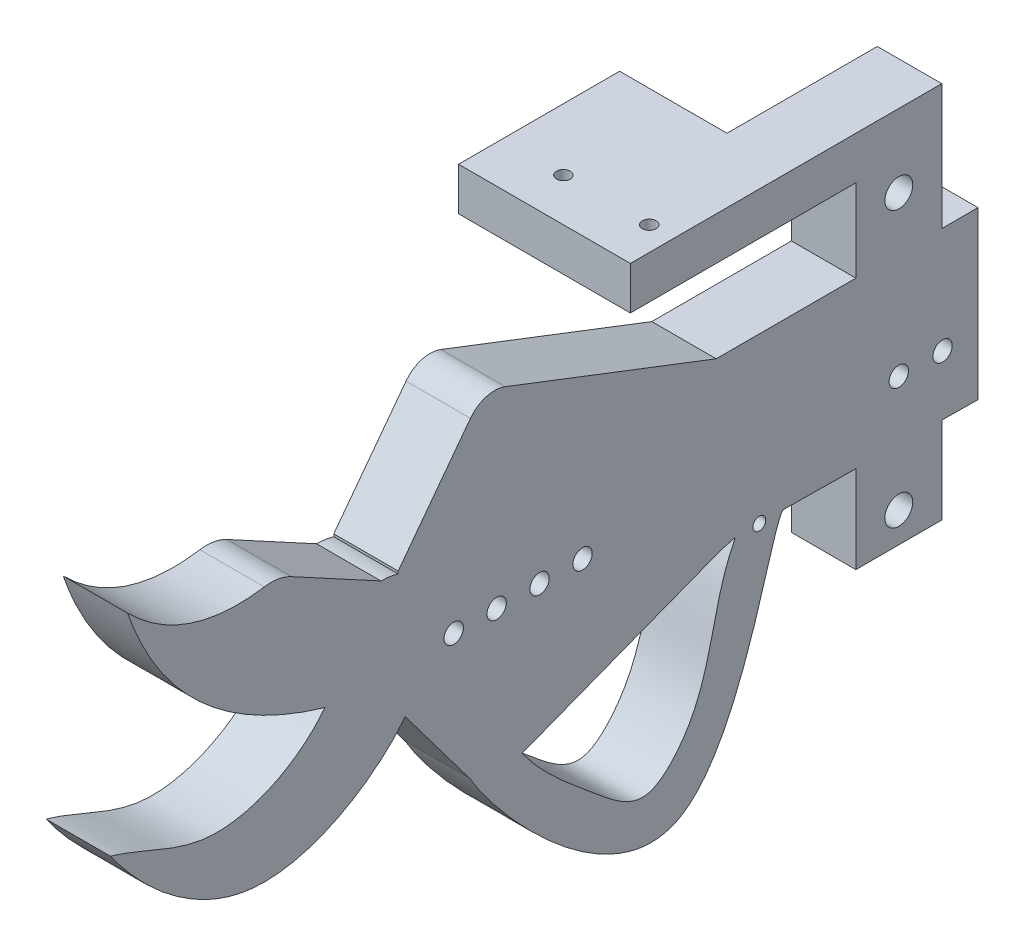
ISO-10303-21;
HEADER;
FILE_DESCRIPTION(('STEP AP214'),'2;1');
FILE_NAME('part.step','',(''),(''),'','','');
FILE_SCHEMA(('AUTOMOTIVE_DESIGN { 1 0 10303 214 1 1 1 1 }'));
ENDSEC;
DATA;
#1=APPLICATION_CONTEXT('core data for automotive mechanical design processes');
#2=APPLICATION_PROTOCOL_DEFINITION('international standard','automotive_design',2000,#1);
#3=PRODUCT_CONTEXT('',#1,'mechanical');
#4=PRODUCT('Part','Part','',(#3));
#5=PRODUCT_RELATED_PRODUCT_CATEGORY('part','',(#4));
#6=PRODUCT_DEFINITION_FORMATION('','',#4);
#7=PRODUCT_DEFINITION_CONTEXT('part definition',#1,'design');
#8=PRODUCT_DEFINITION('design','',#6,#7);
#9=PRODUCT_DEFINITION_SHAPE('','',#8);
#10=(LENGTH_UNIT() NAMED_UNIT(*) SI_UNIT(.MILLI.,.METRE.));
#11=(NAMED_UNIT(*) PLANE_ANGLE_UNIT() SI_UNIT($,.RADIAN.));
#12=(NAMED_UNIT(*) SI_UNIT($,.STERADIAN.) SOLID_ANGLE_UNIT());
#13=UNCERTAINTY_MEASURE_WITH_UNIT(LENGTH_MEASURE(1.E-05),#10,'distance_accuracy_value','');
#14=(GEOMETRIC_REPRESENTATION_CONTEXT(3) GLOBAL_UNCERTAINTY_ASSIGNED_CONTEXT((#13)) GLOBAL_UNIT_ASSIGNED_CONTEXT((#10,
#11,#12)) REPRESENTATION_CONTEXT('',''));
#15=CARTESIAN_POINT('',(0.,0.,0.));
#16=DIRECTION('',(0.,0.,1.));
#17=DIRECTION('',(1.,0.,0.));
#18=AXIS2_PLACEMENT_3D('',#15,#16,#17);
#19=CARTESIAN_POINT('',(63.7161326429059,0.,0.));
#20=DIRECTION('',(1.,0.,0.));
#21=DIRECTION('',(0.,0.,-1.));
#22=AXIS2_PLACEMENT_3D('',#19,#20,#21);
#23=PLANE('',#22);
#24=CARTESIAN_POINT('',(63.7161326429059,-37.2027646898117,176.171363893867));
#25=CARTESIAN_POINT('',(63.7161326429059,-44.0499719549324,171.139612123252));
#26=CARTESIAN_POINT('',(63.7161326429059,-50.611377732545,162.799958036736));
#27=CARTESIAN_POINT('',(63.7161326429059,-63.1004002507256,148.082213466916));
#28=CARTESIAN_POINT('',(63.7161326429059,-46.5744614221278,130.811998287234));
#29=CARTESIAN_POINT('',(63.7161326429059,-30.3522030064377,132.676351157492));
#30=CARTESIAN_POINT('',(63.7161326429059,-18.459363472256,126.491444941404));
#31=B_SPLINE_CURVE_WITH_KNOTS('',3,(#24,#25,#26,#27,#28,#29,#30),.UNSPECIFIED.,.F.,.F.,(4,1,1,1,
4),(0.0606904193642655,0.33424699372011,0.473196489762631,0.580462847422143,0.999065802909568),.UNSPECIFIED.);
#32=CARTESIAN_POINT('',(63.7161326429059,-37.2027646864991,176.171363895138));
#33=VERTEX_POINT('',#32);
#34=CARTESIAN_POINT('',(63.7161326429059,-18.4593634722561,126.491444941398));
#35=VERTEX_POINT('',#34);
#36=EDGE_CURVE('E491',#33,#35,#31,.T.);
#37=ORIENTED_EDGE('',*,*,#36,.T.);
#38=DIRECTION('',(0.,0.261518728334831,-0.965198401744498));
#39=VECTOR('',#38,1.);
#40=CARTESIAN_POINT('',(63.7161326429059,14.7317592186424,3.99154301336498));
#41=LINE('',#40,#39);
#42=CARTESIAN_POINT('',(63.7161326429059,-19.41,130.));
#43=VERTEX_POINT('',#42);
#44=EDGE_CURVE('E502',#43,#35,#41,.T.);
#45=ORIENTED_EDGE('',*,*,#44,.F.);
#46=DIRECTION('',(0.,-0.359587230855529,0.933111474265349));
#47=VECTOR('',#46,1.);
#48=CARTESIAN_POINT('',(63.7161326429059,26.7193170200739,10.2966531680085));
#49=LINE('',#48,#47);
#50=EDGE_CURVE('E496',#43,#33,#49,.T.);
#51=ORIENTED_EDGE('',*,*,#50,.T.);
#52=EDGE_LOOP('',(#37,#45,#51));
#53=FACE_BOUND('',#52,.T.);
#54=CARTESIAN_POINT('',(63.7161326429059,-18.459363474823,120.928461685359));
#55=DIRECTION('',(1.,0.,0.));
#56=DIRECTION('',(0.,0.,-1.));
#57=AXIS2_PLACEMENT_3D('',#54,#55,#56);
#58=CIRCLE('',#57,1.5);
#59=CARTESIAN_POINT('',(63.7161326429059,-18.459363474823,119.428461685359));
#60=VERTEX_POINT('',#59);
#61=EDGE_CURVE('E417',#60,#60,#58,.T.);
#62=ORIENTED_EDGE('',*,*,#61,.T.);
#63=EDGE_LOOP('',(#62));
#64=FACE_BOUND('',#63,.T.);
#65=CARTESIAN_POINT('',(63.7161326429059,-32.,88.4400000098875));
#66=DIRECTION('',(1.,0.,0.));
#67=DIRECTION('',(0.,0.,-1.));
#68=AXIS2_PLACEMENT_3D('',#65,#66,#67);
#69=CIRCLE('',#68,3.25000000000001);
#70=CARTESIAN_POINT('',(63.7161326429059,-32.,85.1900000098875));
#71=VERTEX_POINT('',#70);
#72=EDGE_CURVE('E648',#71,#71,#69,.T.);
#73=ORIENTED_EDGE('',*,*,#72,.T.);
#74=EDGE_LOOP('',(#73));
#75=FACE_BOUND('',#74,.T.);
#76=CARTESIAN_POINT('',(63.7161326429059,-5.00000000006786,88.4400000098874));
#77=DIRECTION('',(1.,0.,0.));
#78=DIRECTION('',(0.,0.,-1.));
#79=AXIS2_PLACEMENT_3D('',#76,#77,#78);
#80=CIRCLE('',#79,2.25);
#81=CARTESIAN_POINT('',(63.7161326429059,-5.00000000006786,86.1900000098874));
#82=VERTEX_POINT('',#81);
#83=EDGE_CURVE('E652',#82,#82,#80,.T.);
#84=ORIENTED_EDGE('',*,*,#83,.T.);
#85=EDGE_LOOP('',(#84));
#86=FACE_BOUND('',#85,.T.);
#87=CARTESIAN_POINT('',(63.7161326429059,32.,88.4400000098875));
#88=DIRECTION('',(1.,0.,0.));
#89=DIRECTION('',(0.,0.,-1.));
#90=AXIS2_PLACEMENT_3D('',#87,#88,#89);
#91=CIRCLE('',#90,3.25000000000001);
#92=CARTESIAN_POINT('',(63.7161326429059,32.,85.1900000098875));
#93=VERTEX_POINT('',#92);
#94=EDGE_CURVE('E651',#93,#93,#91,.T.);
#95=ORIENTED_EDGE('',*,*,#94,.T.);
#96=EDGE_LOOP('',(#95));
#97=FACE_BOUND('',#96,.T.);
#98=CARTESIAN_POINT('',(63.7161326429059,-5.00000000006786,192.076696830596));
#99=DIRECTION('',(-1.,0.,0.));
#100=DIRECTION('',(0.,0.,1.));
#101=AXIS2_PLACEMENT_3D('',#98,#99,#100);
#102=CIRCLE('',#101,2.25000000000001);
#103=CARTESIAN_POINT('',(63.7161326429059,-5.00000000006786,194.326696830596));
#104=VERTEX_POINT('',#103);
#105=EDGE_CURVE('E698',#104,#104,#102,.T.);
#106=ORIENTED_EDGE('',*,*,#105,.F.);
#107=EDGE_LOOP('',(#106));
#108=FACE_BOUND('',#107,.T.);
#109=CARTESIAN_POINT('',(63.7161326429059,-5.00000000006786,182.076696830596));
#110=DIRECTION('',(-1.,0.,0.));
#111=DIRECTION('',(0.,0.,1.));
#112=AXIS2_PLACEMENT_3D('',#109,#110,#111);
#113=CIRCLE('',#112,2.25000000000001);
#114=CARTESIAN_POINT('',(63.7161326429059,-5.00000000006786,184.326696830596));
#115=VERTEX_POINT('',#114);
#116=EDGE_CURVE('E705',#115,#115,#113,.T.);
#117=ORIENTED_EDGE('',*,*,#116,.F.);
#118=EDGE_LOOP('',(#117));
#119=FACE_BOUND('',#118,.T.);
#120=CARTESIAN_POINT('',(63.7161326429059,-5.00000000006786,172.076696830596));
#121=DIRECTION('',(-1.,0.,0.));
#122=DIRECTION('',(0.,0.,1.));
#123=AXIS2_PLACEMENT_3D('',#120,#121,#122);
#124=CIRCLE('',#123,2.25000000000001);
#125=CARTESIAN_POINT('',(63.7161326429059,-5.00000000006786,174.326696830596));
#126=VERTEX_POINT('',#125);
#127=EDGE_CURVE('E1518',#126,#126,#124,.T.);
#128=ORIENTED_EDGE('',*,*,#127,.F.);
#129=EDGE_LOOP('',(#128));
#130=FACE_BOUND('',#129,.T.);
#131=CARTESIAN_POINT('',(63.7161326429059,-5.00000000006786,162.076696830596));
#132=DIRECTION('',(-1.,0.,0.));
#133=DIRECTION('',(0.,0.,1.));
#134=AXIS2_PLACEMENT_3D('',#131,#132,#133);
#135=CIRCLE('',#134,2.25000000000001);
#136=CARTESIAN_POINT('',(63.7161326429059,-5.00000000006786,164.326696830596));
#137=VERTEX_POINT('',#136);
#138=EDGE_CURVE('E1511',#137,#137,#135,.T.);
#139=ORIENTED_EDGE('',*,*,#138,.F.);
#140=EDGE_LOOP('',(#139));
#141=FACE_BOUND('',#140,.T.);
#142=CARTESIAN_POINT('',(63.7161326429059,-5.00000000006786,78.2500000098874));
#143=DIRECTION('',(-1.,0.,0.));
#144=DIRECTION('',(0.,0.,1.));
#145=AXIS2_PLACEMENT_3D('',#142,#143,#144);
#146=CIRCLE('',#145,2.25);
#147=CARTESIAN_POINT('',(63.7161326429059,-5.00000000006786,80.5000000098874));
#148=VERTEX_POINT('',#147);
#149=EDGE_CURVE('E389',#148,#148,#146,.T.);
#150=ORIENTED_EDGE('',*,*,#149,.F.);
#151=EDGE_LOOP('',(#150));
#152=FACE_BOUND('',#151,.T.);
#153=DIRECTION('',(0.,1.,0.));
#154=VECTOR('',#153,1.);
#155=CARTESIAN_POINT('',(63.7161326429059,26.7786970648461,70.000000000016));
#156=LINE('',#155,#154);
#157=CARTESIAN_POINT('',(63.7161326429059,-18.9505950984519,70.000000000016));
#158=VERTEX_POINT('',#157);
#159=CARTESIAN_POINT('',(63.7161326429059,19.7786970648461,70.000000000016));
#160=VERTEX_POINT('',#159);
#161=EDGE_CURVE('E195',#158,#160,#156,.T.);
#162=ORIENTED_EDGE('',*,*,#161,.F.);
#163=DIRECTION('',(0.,-0.0108276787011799,-0.99994137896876));
#164=VECTOR('',#163,1.);
#165=CARTESIAN_POINT('',(63.7161326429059,-19.706266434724,0.213385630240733));
#166=LINE('',#165,#164);
#167=CARTESIAN_POINT('',(63.7161326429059,-18.8592041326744,78.4400000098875));
#168=VERTEX_POINT('',#167);
#169=EDGE_CURVE('E395',#168,#158,#166,.T.);
#170=ORIENTED_EDGE('',*,*,#169,.F.);
#171=DIRECTION('',(0.,1.,0.));
#172=VECTOR('',#171,1.);
#173=CARTESIAN_POINT('',(63.7161326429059,-39.,78.4400000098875));
#174=LINE('',#173,#172);
#175=CARTESIAN_POINT('',(63.7161326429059,-39.,78.4400000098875));
#176=VERTEX_POINT('',#175);
#177=EDGE_CURVE('E656',#176,#168,#174,.T.);
#178=ORIENTED_EDGE('',*,*,#177,.F.);
#179=DIRECTION('',(0.,0.,-1.));
#180=VECTOR('',#179,1.);
#181=CARTESIAN_POINT('',(63.7161326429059,-39.,98.4400000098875));
#182=LINE('',#181,#180);
#183=CARTESIAN_POINT('',(63.7161326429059,-39.,98.4400000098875));
#184=VERTEX_POINT('',#183);
#185=EDGE_CURVE('E661',#184,#176,#182,.T.);
#186=ORIENTED_EDGE('',*,*,#185,.F.);
#187=DIRECTION('',(0.,-1.,0.));
#188=VECTOR('',#187,1.);
#189=CARTESIAN_POINT('',(63.7161326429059,39.,98.4400000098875));
#190=LINE('',#189,#188);
#191=CARTESIAN_POINT('',(63.7161326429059,-18.6426378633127,98.4400000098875));
#192=VERTEX_POINT('',#191);
#193=EDGE_CURVE('E658',#192,#184,#190,.T.);
#194=ORIENTED_EDGE('',*,*,#193,.F.);
#195=DIRECTION('',(0.,-0.0108276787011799,-0.99994137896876));
#196=VECTOR('',#195,1.);
#197=CARTESIAN_POINT('',(63.7161326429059,-19.706266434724,0.213385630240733));
#198=LINE('',#197,#196);
#199=CARTESIAN_POINT('',(63.7161326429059,-18.4593634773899,115.365478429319));
#200=VERTEX_POINT('',#199);
#201=EDGE_CURVE('E426',#200,#192,#198,.T.);
#202=ORIENTED_EDGE('',*,*,#201,.F.);
#203=CARTESIAN_POINT('',(63.7161326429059,-18.4593634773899,115.365478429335));
#204=CARTESIAN_POINT('',(63.7161326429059,-20.6676253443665,118.337689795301));
#205=CARTESIAN_POINT('',(63.7161326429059,-105.183313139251,132.142409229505));
#206=CARTESIAN_POINT('',(63.7161326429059,-46.5278931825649,182.500086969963));
#207=CARTESIAN_POINT('',(63.7161326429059,-36.1623347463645,188.339722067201));
#208=B_SPLINE_CURVE_WITH_KNOTS('',3,(#203,#204,#205,#206,#207),.UNSPECIFIED.,.F.,.F.,(4,1,4),
(0.0326897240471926,0.488322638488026,0.982304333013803),.UNSPECIFIED.);
#209=CARTESIAN_POINT('',(63.7161326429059,-36.1623347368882,188.339722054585));
#210=VERTEX_POINT('',#209);
#211=EDGE_CURVE('E420',#200,#210,#208,.T.);
#212=ORIENTED_EDGE('',*,*,#211,.T.);
#213=DIRECTION('',(0.,-0.79933251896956,-0.600888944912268));
#214=VECTOR('',#213,1.);
#215=CARTESIAN_POINT('',(63.7161326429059,-103.518510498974,137.705498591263));
#216=LINE('',#215,#214);
#217=CARTESIAN_POINT('',(63.7161326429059,-16.199364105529,203.346653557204));
#218=VERTEX_POINT('',#217);
#219=EDGE_CURVE('E485',#218,#210,#216,.T.);
#220=ORIENTED_EDGE('',*,*,#219,.F.);
#221=CARTESIAN_POINT('',(63.7161326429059,-16.1993641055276,203.34665355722));
#222=CARTESIAN_POINT('',(63.7161326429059,-26.080830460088,211.226597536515));
#223=CARTESIAN_POINT('',(63.7161326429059,-42.6420560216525,240.341367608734));
#224=CARTESIAN_POINT('',(63.7161326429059,-20.5889861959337,264.544843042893));
#225=CARTESIAN_POINT('',(63.7161326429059,-10.0000000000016,272.000000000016));
#226=B_SPLINE_CURVE_WITH_KNOTS('',3,(#221,#222,#223,#224,#225),.UNSPECIFIED.,.F.,.F.,(4,1,4),
(0.,0.497870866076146,1.),.UNSPECIFIED.);
#227=CARTESIAN_POINT('',(63.7161326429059,-10.0000000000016,272.000000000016));
#228=VERTEX_POINT('',#227);
#229=EDGE_CURVE('E477',#218,#228,#226,.T.);
#230=ORIENTED_EDGE('',*,*,#229,.T.);
#231=CARTESIAN_POINT('',(63.7161326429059,-10.0000000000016,272.000000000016));
#232=CARTESIAN_POINT('',(63.7161326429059,-12.0829489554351,264.545129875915));
#233=CARTESIAN_POINT('',(63.7161326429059,-22.7664145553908,248.030952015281));
#234=CARTESIAN_POINT('',(63.7161326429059,-13.0000649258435,228.235082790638));
#235=CARTESIAN_POINT('',(63.7161326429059,-5.00000000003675,222.076696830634));
#236=B_SPLINE_CURVE_WITH_KNOTS('',3,(#231,#232,#233,#234,#235),.UNSPECIFIED.,.F.,.F.,(4,1,4),
(0.,0.427590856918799,1.),.UNSPECIFIED.);
#237=CARTESIAN_POINT('',(63.7161326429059,-5.00000000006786,222.076696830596));
#238=VERTEX_POINT('',#237);
#239=EDGE_CURVE('E469',#228,#238,#236,.T.);
#240=ORIENTED_EDGE('',*,*,#239,.T.);
#241=CARTESIAN_POINT('',(63.7161326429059,657794.037003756,-753034.537228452));
#242=CARTESIAN_POINT('',(63.7161326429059,-665899.872181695,746283.094865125));
#243=CARTESIAN_POINT('',(63.7161326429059,674065.457020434,-738510.440835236));
#244=B_SPLINE_CURVE_WITH_KNOTS('',2,(#241,#242,#243),.UNSPECIFIED.,.F.,.F.,(3,3),(0.,1.),.UNSPECIFIED.);
#245=CARTESIAN_POINT('',(63.7161326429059,37.0000000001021,268.000000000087));
#246=VERTEX_POINT('',#245);
#247=EDGE_CURVE('E461',#238,#246,#244,.T.);
#248=ORIENTED_EDGE('',*,*,#247,.T.);
#249=CARTESIAN_POINT('',(63.7161326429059,36.9999999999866,268.000000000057));
#250=CARTESIAN_POINT('',(63.7161326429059,28.0951536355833,259.138798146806));
#251=CARTESIAN_POINT('',(63.7161326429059,24.489684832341,248.271123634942));
#252=CARTESIAN_POINT('',(63.7161326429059,26.3860977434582,236.172225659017));
#253=B_SPLINE_CURVE_WITH_KNOTS('',3,(#249,#250,#251,#252),.UNSPECIFIED.,.F.,.F.,(4,4),(0.,
0.920406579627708),.UNSPECIFIED.);
#254=CARTESIAN_POINT('',(63.7161326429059,26.386097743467,236.172225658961));
#255=VERTEX_POINT('',#254);
#256=EDGE_CURVE('E456',#246,#255,#253,.T.);
#257=ORIENTED_EDGE('',*,*,#256,.T.);
#258=CARTESIAN_POINT('',(63.7161326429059,16.5067208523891,234.62370628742));
#259=DIRECTION('',(1.,0.,0.));
#260=DIRECTION('',(0.,0.,-1.));
#261=AXIS2_PLACEMENT_3D('',#258,#259,#260);
#262=CIRCLE('',#261,10.);
#263=CARTESIAN_POINT('',(63.7161326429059,25.2996405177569,229.860874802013));
#264=VERTEX_POINT('',#263);
#265=EDGE_CURVE('E453',#264,#255,#262,.T.);
#266=ORIENTED_EDGE('',*,*,#265,.F.);
#267=DIRECTION('',(0.,-0.476283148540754,-0.879291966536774));
#268=VECTOR('',#267,1.);
#269=CARTESIAN_POINT('',(63.7161326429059,-76.7033557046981,41.5476510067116));
#270=LINE('',#269,#268);
#271=CARTESIAN_POINT('',(63.7161326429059,14.,209.));
#272=VERTEX_POINT('',#271);
#273=EDGE_CURVE('E450',#264,#272,#270,.T.);
#274=ORIENTED_EDGE('',*,*,#273,.T.);
#275=CARTESIAN_POINT('',(63.7161326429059,0.,209.));
#276=DIRECTION('',(1.,0.,0.));
#277=DIRECTION('',(0.,0.,-1.));
#278=AXIS2_PLACEMENT_3D('',#275,#276,#277);
#279=CIRCLE('',#278,13.9999999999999);
#280=CARTESIAN_POINT('',(63.7161326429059,13.4164078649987,205.));
#281=VERTEX_POINT('',#280);
#282=EDGE_CURVE('E447',#281,#272,#279,.T.);
#283=ORIENTED_EDGE('',*,*,#282,.F.);
#284=DIRECTION('',(0.,1.,0.));
#285=VECTOR('',#284,1.);
#286=CARTESIAN_POINT('',(63.7161326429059,0.,205.));
#287=LINE('',#286,#285);
#288=CARTESIAN_POINT('',(63.7161326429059,14.,205.));
#289=VERTEX_POINT('',#288);
#290=EDGE_CURVE('E444',#281,#289,#287,.T.);
#291=ORIENTED_EDGE('',*,*,#290,.T.);
#292=DIRECTION('',(0.,0.799332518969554,-0.600888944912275));
#293=VECTOR('',#292,1.);
#294=CARTESIAN_POINT('',(63.7161326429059,103.518510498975,137.705498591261));
#295=LINE('',#294,#293);
#296=CARTESIAN_POINT('',(63.7161326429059,36.3777940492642,188.177753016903));
#297=VERTEX_POINT('',#296);
#298=EDGE_CURVE('E441',#289,#297,#295,.T.);
#299=ORIENTED_EDGE('',*,*,#298,.T.);
#300=CARTESIAN_POINT('',(63.7161326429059,32.1715714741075,182.58242524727));
#301=DIRECTION('',(1.,0.,0.));
#302=DIRECTION('',(0.,0.,-1.));
#303=AXIS2_PLACEMENT_3D('',#300,#301,#302);
#304=CIRCLE('',#303,7.);
#305=CARTESIAN_POINT('',(63.7161326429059,38.7033517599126,180.065314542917));
#306=VERTEX_POINT('',#305);
#307=EDGE_CURVE('E438',#306,#297,#304,.T.);
#308=ORIENTED_EDGE('',*,*,#307,.F.);
#309=DIRECTION('',(0.,-0.359587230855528,-0.933111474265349));
#310=VECTOR('',#309,1.);
#311=CARTESIAN_POINT('',(63.7161326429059,-26.7193169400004,10.2966531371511));
#312=LINE('',#311,#310);
#313=CARTESIAN_POINT('',(63.7161326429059,19.7786970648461,130.956750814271));
#314=VERTEX_POINT('',#313);
#315=EDGE_CURVE('E435',#306,#314,#312,.T.);
#316=ORIENTED_EDGE('',*,*,#315,.T.);
#317=DIRECTION('',(0.,0.,-1.));
#318=VECTOR('',#317,1.);
#319=CARTESIAN_POINT('',(63.7161326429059,19.7786970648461,0.));
#320=LINE('',#319,#318);
#321=CARTESIAN_POINT('',(63.7161326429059,19.7786970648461,98.4400000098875));
#322=VERTEX_POINT('',#321);
#323=EDGE_CURVE('E432',#314,#322,#320,.T.);
#324=ORIENTED_EDGE('',*,*,#323,.T.);
#325=CARTESIAN_POINT('',(63.7161326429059,39.,98.4400000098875));
#326=VERTEX_POINT('',#325);
#327=EDGE_CURVE('E659',#326,#322,#190,.T.);
#328=ORIENTED_EDGE('',*,*,#327,.F.);
#329=DIRECTION('',(0.,0.,-1.));
#330=VECTOR('',#329,1.);
#331=CARTESIAN_POINT('',(63.7161326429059,39.,150.940000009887));
#332=LINE('',#331,#330);
#333=CARTESIAN_POINT('',(63.7161326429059,39.,113.440000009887));
#334=VERTEX_POINT('',#333);
#335=EDGE_CURVE('E188',#334,#326,#332,.T.);
#336=ORIENTED_EDGE('',*,*,#335,.F.);
#337=DIRECTION('',(0.,1.,0.));
#338=VECTOR('',#337,1.);
#339=CARTESIAN_POINT('',(63.7161326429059,28.,113.440000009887));
#340=LINE('',#339,#338);
#341=CARTESIAN_POINT('',(63.7161326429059,49.,113.440000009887));
#342=VERTEX_POINT('',#341);
#343=EDGE_CURVE('E716',#334,#342,#340,.T.);
#344=ORIENTED_EDGE('',*,*,#343,.T.);
#345=DIRECTION('',(0.,0.,-1.));
#346=VECTOR('',#345,1.);
#347=CARTESIAN_POINT('',(63.7161326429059,49.,78.4400000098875));
#348=LINE('',#347,#346);
#349=CARTESIAN_POINT('',(63.7161326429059,49.,78.4400000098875));
#350=VERTEX_POINT('',#349);
#351=EDGE_CURVE('E702',#342,#350,#348,.T.);
#352=ORIENTED_EDGE('',*,*,#351,.T.);
#353=CARTESIAN_POINT('',(63.7161326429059,19.7786970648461,78.4400000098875));
#354=VERTEX_POINT('',#353);
#355=EDGE_CURVE('E655',#354,#350,#174,.T.);
#356=ORIENTED_EDGE('',*,*,#355,.F.);
#357=DIRECTION('',(0.,0.,-1.));
#358=VECTOR('',#357,1.);
#359=CARTESIAN_POINT('',(63.7161326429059,19.7786970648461,0.));
#360=LINE('',#359,#358);
#361=EDGE_CURVE('E398',#354,#160,#360,.T.);
#362=ORIENTED_EDGE('',*,*,#361,.T.);
#363=EDGE_LOOP('',(#162,#170,#178,#186,#194,#202,#212,#220,#230,#240,#248,#257,#266,#274,#283,
#291,#299,#308,#316,#324,#328,#336,#344,#352,#356,#362));
#364=FACE_BOUND('',#363,.T.);
#365=ADVANCED_FACE('F180',(#53,#64,#75,#86,#97,#108,#119,#130,#141,#152,#364),#23,.F.);
#366=CARTESIAN_POINT('',(78.7161326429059,0.,0.));
#367=DIRECTION('',(1.,0.,0.));
#368=DIRECTION('',(0.,0.,-1.));
#369=AXIS2_PLACEMENT_3D('',#366,#367,#368);
#370=PLANE('',#369);
#371=CARTESIAN_POINT('',(78.7161326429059,-37.2027646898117,176.171363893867));
#372=CARTESIAN_POINT('',(78.7161326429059,-44.0499719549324,171.139612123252));
#373=CARTESIAN_POINT('',(78.7161326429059,-50.611377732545,162.799958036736));
#374=CARTESIAN_POINT('',(78.7161326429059,-63.1004002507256,148.082213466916));
#375=CARTESIAN_POINT('',(78.7161326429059,-46.5744614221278,130.811998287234));
#376=CARTESIAN_POINT('',(78.7161326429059,-30.3522030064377,132.676351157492));
#377=CARTESIAN_POINT('',(78.7161326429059,-18.459363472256,126.491444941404));
#378=B_SPLINE_CURVE_WITH_KNOTS('',3,(#371,#372,#373,#374,#375,#376,#377),.UNSPECIFIED.,.F.,.F.,
(4,1,1,1,4),(0.0606904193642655,0.33424699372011,0.473196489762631,0.580462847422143,
0.999065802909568),.UNSPECIFIED.);
#379=CARTESIAN_POINT('',(78.7161326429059,-37.2027646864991,176.171363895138));
#380=VERTEX_POINT('',#379);
#381=CARTESIAN_POINT('',(78.7161326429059,-18.4593634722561,126.491444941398));
#382=VERTEX_POINT('',#381);
#383=EDGE_CURVE('E593',#380,#382,#378,.T.);
#384=ORIENTED_EDGE('',*,*,#383,.F.);
#385=DIRECTION('',(0.,-0.359587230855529,0.933111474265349));
#386=VECTOR('',#385,1.);
#387=CARTESIAN_POINT('',(78.7161326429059,26.7193170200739,10.2966531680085));
#388=LINE('',#387,#386);
#389=CARTESIAN_POINT('',(78.7161326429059,-19.41,130.));
#390=VERTEX_POINT('',#389);
#391=EDGE_CURVE('E600',#390,#380,#388,.T.);
#392=ORIENTED_EDGE('',*,*,#391,.F.);
#393=DIRECTION('',(0.,0.261518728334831,-0.965198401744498));
#394=VECTOR('',#393,1.);
#395=CARTESIAN_POINT('',(78.7161326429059,14.7317592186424,3.99154301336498));
#396=LINE('',#395,#394);
#397=EDGE_CURVE('E608',#390,#382,#396,.T.);
#398=ORIENTED_EDGE('',*,*,#397,.T.);
#399=EDGE_LOOP('',(#384,#392,#398));
#400=FACE_BOUND('',#399,.T.);
#401=CARTESIAN_POINT('',(78.7161326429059,-18.459363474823,120.928461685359));
#402=DIRECTION('',(1.,0.,0.));
#403=DIRECTION('',(0.,0.,-1.));
#404=AXIS2_PLACEMENT_3D('',#401,#402,#403);
#405=CIRCLE('',#404,1.5);
#406=CARTESIAN_POINT('',(78.7161326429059,-18.459363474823,119.428461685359));
#407=VERTEX_POINT('',#406);
#408=EDGE_CURVE('E505',#407,#407,#405,.T.);
#409=ORIENTED_EDGE('',*,*,#408,.F.);
#410=EDGE_LOOP('',(#409));
#411=FACE_BOUND('',#410,.T.);
#412=CARTESIAN_POINT('',(78.7161326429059,-32.,88.4400000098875));
#413=DIRECTION('',(1.,0.,0.));
#414=DIRECTION('',(0.,0.,-1.));
#415=AXIS2_PLACEMENT_3D('',#412,#413,#414);
#416=CIRCLE('',#415,3.25000000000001);
#417=CARTESIAN_POINT('',(78.7161326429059,-32.,85.1900000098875));
#418=VERTEX_POINT('',#417);
#419=EDGE_CURVE('E664',#418,#418,#416,.T.);
#420=ORIENTED_EDGE('',*,*,#419,.F.);
#421=EDGE_LOOP('',(#420));
#422=FACE_BOUND('',#421,.T.);
#423=CARTESIAN_POINT('',(78.7161326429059,32.,88.4400000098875));
#424=DIRECTION('',(1.,0.,0.));
#425=DIRECTION('',(0.,0.,-1.));
#426=AXIS2_PLACEMENT_3D('',#423,#424,#425);
#427=CIRCLE('',#426,3.25000000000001);
#428=CARTESIAN_POINT('',(78.7161326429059,32.,85.1900000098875));
#429=VERTEX_POINT('',#428);
#430=EDGE_CURVE('E667',#429,#429,#427,.T.);
#431=ORIENTED_EDGE('',*,*,#430,.F.);
#432=EDGE_LOOP('',(#431));
#433=FACE_BOUND('',#432,.T.);
#434=CARTESIAN_POINT('',(78.7161326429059,-5.00000000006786,88.4400000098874));
#435=DIRECTION('',(1.,0.,0.));
#436=DIRECTION('',(0.,0.,-1.));
#437=AXIS2_PLACEMENT_3D('',#434,#435,#436);
#438=CIRCLE('',#437,2.25);
#439=CARTESIAN_POINT('',(78.7161326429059,-5.00000000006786,86.1900000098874));
#440=VERTEX_POINT('',#439);
#441=EDGE_CURVE('E685',#440,#440,#438,.T.);
#442=ORIENTED_EDGE('',*,*,#441,.F.);
#443=EDGE_LOOP('',(#442));
#444=FACE_BOUND('',#443,.T.);
#445=CARTESIAN_POINT('',(78.7161326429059,-5.00000000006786,192.076696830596));
#446=DIRECTION('',(1.,0.,0.));
#447=DIRECTION('',(0.,0.,-1.));
#448=AXIS2_PLACEMENT_3D('',#445,#446,#447);
#449=CIRCLE('',#448,2.25000000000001);
#450=CARTESIAN_POINT('',(78.7161326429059,-5.00000000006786,189.826696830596));
#451=VERTEX_POINT('',#450);
#452=EDGE_CURVE('E695',#451,#451,#449,.T.);
#453=ORIENTED_EDGE('',*,*,#452,.F.);
#454=EDGE_LOOP('',(#453));
#455=FACE_BOUND('',#454,.T.);
#456=CARTESIAN_POINT('',(78.7161326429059,-5.00000000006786,182.076696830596));
#457=DIRECTION('',(1.,0.,0.));
#458=DIRECTION('',(0.,0.,-1.));
#459=AXIS2_PLACEMENT_3D('',#456,#457,#458);
#460=CIRCLE('',#459,2.25000000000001);
#461=CARTESIAN_POINT('',(78.7161326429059,-5.00000000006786,179.826696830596));
#462=VERTEX_POINT('',#461);
#463=EDGE_CURVE('E710',#462,#462,#460,.T.);
#464=ORIENTED_EDGE('',*,*,#463,.F.);
#465=EDGE_LOOP('',(#464));
#466=FACE_BOUND('',#465,.T.);
#467=CARTESIAN_POINT('',(78.7161326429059,-5.00000000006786,172.076696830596));
#468=DIRECTION('',(1.,0.,0.));
#469=DIRECTION('',(0.,0.,-1.));
#470=AXIS2_PLACEMENT_3D('',#467,#468,#469);
#471=CIRCLE('',#470,2.25000000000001);
#472=CARTESIAN_POINT('',(78.7161326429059,-5.00000000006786,169.826696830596));
#473=VERTEX_POINT('',#472);
#474=EDGE_CURVE('E761',#473,#473,#471,.T.);
#475=ORIENTED_EDGE('',*,*,#474,.F.);
#476=EDGE_LOOP('',(#475));
#477=FACE_BOUND('',#476,.T.);
#478=CARTESIAN_POINT('',(78.7161326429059,-5.00000000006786,162.076696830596));
#479=DIRECTION('',(1.,0.,0.));
#480=DIRECTION('',(0.,0.,-1.));
#481=AXIS2_PLACEMENT_3D('',#478,#479,#480);
#482=CIRCLE('',#481,2.25000000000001);
#483=CARTESIAN_POINT('',(78.7161326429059,-5.00000000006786,159.826696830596));
#484=VERTEX_POINT('',#483);
#485=EDGE_CURVE('E765',#484,#484,#482,.T.);
#486=ORIENTED_EDGE('',*,*,#485,.F.);
#487=EDGE_LOOP('',(#486));
#488=FACE_BOUND('',#487,.T.);
#489=CARTESIAN_POINT('',(78.7161326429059,-5.00000000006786,78.2500000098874));
#490=DIRECTION('',(1.,0.,0.));
#491=DIRECTION('',(0.,0.,-1.));
#492=AXIS2_PLACEMENT_3D('',#489,#490,#491);
#493=CIRCLE('',#492,2.25);
#494=CARTESIAN_POINT('',(78.7161326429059,-5.00000000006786,76.0000000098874));
#495=VERTEX_POINT('',#494);
#496=EDGE_CURVE('E769',#495,#495,#493,.F.);
#497=ORIENTED_EDGE('',*,*,#496,.T.);
#498=EDGE_LOOP('',(#497));
#499=FACE_BOUND('',#498,.T.);
#500=DIRECTION('',(0.,-0.0108276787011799,-0.99994137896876));
#501=VECTOR('',#500,1.);
#502=CARTESIAN_POINT('',(78.7161326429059,-19.706266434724,0.213385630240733));
#503=LINE('',#502,#501);
#504=CARTESIAN_POINT('',(78.7161326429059,-18.8592041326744,78.4400000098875));
#505=VERTEX_POINT('',#504);
#506=CARTESIAN_POINT('',(78.7161326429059,-18.9505950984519,70.000000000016));
#507=VERTEX_POINT('',#506);
#508=EDGE_CURVE('E406',#505,#507,#503,.T.);
#509=ORIENTED_EDGE('',*,*,#508,.T.);
#510=DIRECTION('',(0.,-1.,0.));
#511=VECTOR('',#510,1.);
#512=CARTESIAN_POINT('',(78.7161326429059,26.7786970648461,70.000000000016));
#513=LINE('',#512,#511);
#514=CARTESIAN_POINT('',(78.7161326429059,19.7786970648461,70.000000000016));
#515=VERTEX_POINT('',#514);
#516=EDGE_CURVE('E384',#515,#507,#513,.T.);
#517=ORIENTED_EDGE('',*,*,#516,.F.);
#518=DIRECTION('',(0.,0.,-1.));
#519=VECTOR('',#518,1.);
#520=CARTESIAN_POINT('',(78.7161326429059,19.7786970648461,0.));
#521=LINE('',#520,#519);
#522=CARTESIAN_POINT('',(78.7161326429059,19.7786970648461,78.4400000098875));
#523=VERTEX_POINT('',#522);
#524=EDGE_CURVE('E403',#523,#515,#521,.T.);
#525=ORIENTED_EDGE('',*,*,#524,.F.);
#526=DIRECTION('',(0.,1.,0.));
#527=VECTOR('',#526,1.);
#528=CARTESIAN_POINT('',(78.7161326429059,-39.,78.4400000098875));
#529=LINE('',#528,#527);
#530=CARTESIAN_POINT('',(78.7161326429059,49.,78.4400000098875));
#531=VERTEX_POINT('',#530);
#532=EDGE_CURVE('E670',#523,#531,#529,.T.);
#533=ORIENTED_EDGE('',*,*,#532,.T.);
#534=DIRECTION('',(0.,0.,-1.));
#535=VECTOR('',#534,1.);
#536=CARTESIAN_POINT('',(78.7161326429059,49.,78.4400000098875));
#537=LINE('',#536,#535);
#538=CARTESIAN_POINT('',(78.7161326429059,49.,150.940000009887));
#539=VERTEX_POINT('',#538);
#540=EDGE_CURVE('E743',#539,#531,#537,.T.);
#541=ORIENTED_EDGE('',*,*,#540,.F.);
#542=DIRECTION('',(0.,1.,0.));
#543=VECTOR('',#542,1.);
#544=CARTESIAN_POINT('',(78.7161326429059,49.,150.940000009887));
#545=LINE('',#544,#543);
#546=CARTESIAN_POINT('',(78.7161326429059,39.,150.940000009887));
#547=VERTEX_POINT('',#546);
#548=EDGE_CURVE('E734',#547,#539,#545,.T.);
#549=ORIENTED_EDGE('',*,*,#548,.F.);
#550=DIRECTION('',(0.,0.,-1.));
#551=VECTOR('',#550,1.);
#552=CARTESIAN_POINT('',(78.7161326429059,39.,150.940000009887));
#553=LINE('',#552,#551);
#554=CARTESIAN_POINT('',(78.7161326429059,39.,98.4400000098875));
#555=VERTEX_POINT('',#554);
#556=EDGE_CURVE('E739',#547,#555,#553,.T.);
#557=ORIENTED_EDGE('',*,*,#556,.T.);
#558=DIRECTION('',(0.,-1.,0.));
#559=VECTOR('',#558,1.);
#560=CARTESIAN_POINT('',(78.7161326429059,39.,98.4400000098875));
#561=LINE('',#560,#559);
#562=CARTESIAN_POINT('',(78.7161326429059,19.7786970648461,98.4400000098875));
#563=VERTEX_POINT('',#562);
#564=EDGE_CURVE('E675',#555,#563,#561,.T.);
#565=ORIENTED_EDGE('',*,*,#564,.T.);
#566=DIRECTION('',(0.,0.,-1.));
#567=VECTOR('',#566,1.);
#568=CARTESIAN_POINT('',(78.7161326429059,19.7786970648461,0.));
#569=LINE('',#568,#567);
#570=CARTESIAN_POINT('',(78.7161326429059,19.7786970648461,130.956750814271));
#571=VERTEX_POINT('',#570);
#572=EDGE_CURVE('E868',#571,#563,#569,.T.);
#573=ORIENTED_EDGE('',*,*,#572,.F.);
#574=DIRECTION('',(0.,-0.359587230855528,-0.933111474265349));
#575=VECTOR('',#574,1.);
#576=CARTESIAN_POINT('',(78.7161326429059,-26.7193169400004,10.2966531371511));
#577=LINE('',#576,#575);
#578=CARTESIAN_POINT('',(78.7161326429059,38.7033517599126,180.065314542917));
#579=VERTEX_POINT('',#578);
#580=EDGE_CURVE('E876',#579,#571,#577,.T.);
#581=ORIENTED_EDGE('',*,*,#580,.F.);
#582=CARTESIAN_POINT('',(78.7161326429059,32.1715714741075,182.58242524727));
#583=DIRECTION('',(1.,0.,0.));
#584=DIRECTION('',(0.,0.,-1.));
#585=AXIS2_PLACEMENT_3D('',#582,#583,#584);
#586=CIRCLE('',#585,7.);
#587=CARTESIAN_POINT('',(78.7161326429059,36.3777940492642,188.177753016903));
#588=VERTEX_POINT('',#587);
#589=EDGE_CURVE('E877',#579,#588,#586,.T.);
#590=ORIENTED_EDGE('',*,*,#589,.T.);
#591=DIRECTION('',(0.,0.799332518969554,-0.600888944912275));
#592=VECTOR('',#591,1.);
#593=CARTESIAN_POINT('',(78.7161326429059,103.518510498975,137.705498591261));
#594=LINE('',#593,#592);
#595=CARTESIAN_POINT('',(78.7161326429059,14.,205.));
#596=VERTEX_POINT('',#595);
#597=EDGE_CURVE('E881',#596,#588,#594,.T.);
#598=ORIENTED_EDGE('',*,*,#597,.F.);
#599=DIRECTION('',(0.,1.,0.));
#600=VECTOR('',#599,1.);
#601=CARTESIAN_POINT('',(78.7161326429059,0.,205.));
#602=LINE('',#601,#600);
#603=CARTESIAN_POINT('',(78.7161326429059,13.4164078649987,205.));
#604=VERTEX_POINT('',#603);
#605=EDGE_CURVE('E884',#604,#596,#602,.T.);
#606=ORIENTED_EDGE('',*,*,#605,.F.);
#607=CARTESIAN_POINT('',(78.7161326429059,0.,209.));
#608=DIRECTION('',(1.,0.,0.));
#609=DIRECTION('',(0.,0.,-1.));
#610=AXIS2_PLACEMENT_3D('',#607,#608,#609);
#611=CIRCLE('',#610,13.9999999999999);
#612=CARTESIAN_POINT('',(78.7161326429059,14.,209.));
#613=VERTEX_POINT('',#612);
#614=EDGE_CURVE('E887',#604,#613,#611,.T.);
#615=ORIENTED_EDGE('',*,*,#614,.T.);
#616=DIRECTION('',(0.,-0.476283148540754,-0.879291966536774));
#617=VECTOR('',#616,1.);
#618=CARTESIAN_POINT('',(78.7161326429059,-76.7033557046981,41.5476510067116));
#619=LINE('',#618,#617);
#620=CARTESIAN_POINT('',(78.7161326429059,25.2996405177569,229.860874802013));
#621=VERTEX_POINT('',#620);
#622=EDGE_CURVE('E889',#621,#613,#619,.T.);
#623=ORIENTED_EDGE('',*,*,#622,.F.);
#624=CARTESIAN_POINT('',(78.7161326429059,16.5067208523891,234.62370628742));
#625=DIRECTION('',(1.,0.,0.));
#626=DIRECTION('',(0.,0.,-1.));
#627=AXIS2_PLACEMENT_3D('',#624,#625,#626);
#628=CIRCLE('',#627,10.);
#629=CARTESIAN_POINT('',(78.7161326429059,26.386097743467,236.172225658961));
#630=VERTEX_POINT('',#629);
#631=EDGE_CURVE('E812',#621,#630,#628,.T.);
#632=ORIENTED_EDGE('',*,*,#631,.T.);
#633=CARTESIAN_POINT('',(78.7161326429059,36.9999999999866,268.000000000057));
#634=CARTESIAN_POINT('',(78.7161326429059,28.0951536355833,259.138798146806));
#635=CARTESIAN_POINT('',(78.7161326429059,24.489684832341,248.271123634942));
#636=CARTESIAN_POINT('',(78.7161326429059,26.3860977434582,236.172225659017));
#637=B_SPLINE_CURVE_WITH_KNOTS('',3,(#633,#634,#635,#636),.UNSPECIFIED.,.F.,.F.,(4,4),(0.,
0.920406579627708),.UNSPECIFIED.);
#638=CARTESIAN_POINT('',(78.7161326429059,37.0000000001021,268.000000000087));
#639=VERTEX_POINT('',#638);
#640=EDGE_CURVE('E808',#639,#630,#637,.T.);
#641=ORIENTED_EDGE('',*,*,#640,.F.);
#642=CARTESIAN_POINT('',(78.7161326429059,657794.037003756,-753034.537228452));
#643=CARTESIAN_POINT('',(78.7161326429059,-665899.872181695,746283.094865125));
#644=CARTESIAN_POINT('',(78.7161326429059,674065.457020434,-738510.440835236));
#645=B_SPLINE_CURVE_WITH_KNOTS('',2,(#642,#643,#644),.UNSPECIFIED.,.F.,.F.,(3,3),(0.,1.),.UNSPECIFIED.);
#646=CARTESIAN_POINT('',(78.7161326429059,-5.00000000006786,222.076696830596));
#647=VERTEX_POINT('',#646);
#648=EDGE_CURVE('E805',#647,#639,#645,.T.);
#649=ORIENTED_EDGE('',*,*,#648,.F.);
#650=CARTESIAN_POINT('',(78.7161326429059,-10.0000000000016,272.000000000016));
#651=CARTESIAN_POINT('',(78.7161326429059,-12.0829489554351,264.545129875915));
#652=CARTESIAN_POINT('',(78.7161326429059,-22.7664145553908,248.030952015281));
#653=CARTESIAN_POINT('',(78.7161326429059,-13.0000649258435,228.235082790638));
#654=CARTESIAN_POINT('',(78.7161326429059,-5.00000000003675,222.076696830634));
#655=B_SPLINE_CURVE_WITH_KNOTS('',3,(#650,#651,#652,#653,#654),.UNSPECIFIED.,.F.,.F.,(4,1,4),
(0.,0.427590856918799,1.),.UNSPECIFIED.);
#656=CARTESIAN_POINT('',(78.7161326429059,-10.0000000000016,272.000000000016));
#657=VERTEX_POINT('',#656);
#658=EDGE_CURVE('E800',#657,#647,#655,.T.);
#659=ORIENTED_EDGE('',*,*,#658,.F.);
#660=CARTESIAN_POINT('',(78.7161326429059,-16.1993641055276,203.34665355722));
#661=CARTESIAN_POINT('',(78.7161326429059,-26.080830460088,211.226597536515));
#662=CARTESIAN_POINT('',(78.7161326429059,-42.6420560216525,240.341367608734));
#663=CARTESIAN_POINT('',(78.7161326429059,-20.5889861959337,264.544843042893));
#664=CARTESIAN_POINT('',(78.7161326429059,-10.0000000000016,272.000000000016));
#665=B_SPLINE_CURVE_WITH_KNOTS('',3,(#660,#661,#662,#663,#664),.UNSPECIFIED.,.F.,.F.,(4,1,4),
(0.,0.497870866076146,1.),.UNSPECIFIED.);
#666=CARTESIAN_POINT('',(78.7161326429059,-16.199364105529,203.346653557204));
#667=VERTEX_POINT('',#666);
#668=EDGE_CURVE('E810',#667,#657,#665,.T.);
#669=ORIENTED_EDGE('',*,*,#668,.F.);
#670=DIRECTION('',(0.,-0.79933251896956,-0.600888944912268));
#671=VECTOR('',#670,1.);
#672=CARTESIAN_POINT('',(78.7161326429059,-103.518510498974,137.705498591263));
#673=LINE('',#672,#671);
#674=CARTESIAN_POINT('',(78.7161326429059,-36.1623347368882,188.339722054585));
#675=VERTEX_POINT('',#674);
#676=EDGE_CURVE('E601',#667,#675,#673,.T.);
#677=ORIENTED_EDGE('',*,*,#676,.T.);
#678=CARTESIAN_POINT('',(78.7161326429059,-18.4593634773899,115.365478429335));
#679=CARTESIAN_POINT('',(78.7161326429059,-20.6676253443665,118.337689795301));
#680=CARTESIAN_POINT('',(78.7161326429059,-105.183313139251,132.142409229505));
#681=CARTESIAN_POINT('',(78.7161326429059,-46.5278931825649,182.500086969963));
#682=CARTESIAN_POINT('',(78.7161326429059,-36.1623347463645,188.339722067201));
#683=B_SPLINE_CURVE_WITH_KNOTS('',3,(#678,#679,#680,#681,#682),.UNSPECIFIED.,.F.,.F.,(4,1,4),
(0.0326897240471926,0.488322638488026,0.982304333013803),.UNSPECIFIED.);
#684=CARTESIAN_POINT('',(78.7161326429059,-18.4593634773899,115.365478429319));
#685=VERTEX_POINT('',#684);
#686=EDGE_CURVE('E508',#685,#675,#683,.T.);
#687=ORIENTED_EDGE('',*,*,#686,.F.);
#688=DIRECTION('',(0.,-0.0108276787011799,-0.99994137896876));
#689=VECTOR('',#688,1.);
#690=CARTESIAN_POINT('',(78.7161326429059,-19.706266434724,0.213385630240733));
#691=LINE('',#690,#689);
#692=CARTESIAN_POINT('',(78.7161326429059,-18.6426378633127,98.4400000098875));
#693=VERTEX_POINT('',#692);
#694=EDGE_CURVE('E514',#685,#693,#691,.T.);
#695=ORIENTED_EDGE('',*,*,#694,.T.);
#696=CARTESIAN_POINT('',(78.7161326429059,-39.,98.4400000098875));
#697=VERTEX_POINT('',#696);
#698=EDGE_CURVE('E674',#693,#697,#561,.T.);
#699=ORIENTED_EDGE('',*,*,#698,.T.);
#700=DIRECTION('',(0.,0.,-1.));
#701=VECTOR('',#700,1.);
#702=CARTESIAN_POINT('',(78.7161326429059,-39.,98.4400000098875));
#703=LINE('',#702,#701);
#704=CARTESIAN_POINT('',(78.7161326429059,-39.,78.4400000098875));
#705=VERTEX_POINT('',#704);
#706=EDGE_CURVE('E677',#697,#705,#703,.T.);
#707=ORIENTED_EDGE('',*,*,#706,.T.);
#708=EDGE_CURVE('E671',#705,#505,#529,.T.);
#709=ORIENTED_EDGE('',*,*,#708,.T.);
#710=EDGE_LOOP('',(#509,#517,#525,#533,#541,#549,#557,#565,#573,#581,#590,#598,#606,#615,#623,
#632,#641,#649,#659,#669,#677,#687,#695,#699,#707,#709));
#711=FACE_BOUND('',#710,.T.);
#712=ADVANCED_FACE('F568',(#400,#411,#422,#433,#444,#455,#466,#477,#488,#499,#711),#370,.T.);
#713=CARTESIAN_POINT('',(78.7161326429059,-19.706266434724,0.213385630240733));
#714=DIRECTION('',(0.,0.999941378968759,-0.0108276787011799));
#715=DIRECTION('',(0.,0.0108276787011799,0.999941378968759));
#716=AXIS2_PLACEMENT_3D('',#713,#714,#715);
#717=PLANE('',#716);
#718=DIRECTION('',(-1.,0.,0.));
#719=VECTOR('',#718,1.);
#720=CARTESIAN_POINT('',(78.7161326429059,-18.9505950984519,70.000000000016));
#721=LINE('',#720,#719);
#722=EDGE_CURVE('E381',#507,#158,#721,.T.);
#723=ORIENTED_EDGE('',*,*,#722,.F.);
#724=ORIENTED_EDGE('',*,*,#508,.F.);
#725=DIRECTION('',(-1.,0.,0.));
#726=VECTOR('',#725,1.);
#727=CARTESIAN_POINT('',(78.7161326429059,-18.8592041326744,78.4400000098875));
#728=LINE('',#727,#726);
#729=EDGE_CURVE('E401',#505,#168,#728,.T.);
#730=ORIENTED_EDGE('',*,*,#729,.T.);
#731=ORIENTED_EDGE('',*,*,#169,.T.);
#732=EDGE_LOOP('',(#723,#724,#730,#731));
#733=FACE_BOUND('',#732,.T.);
#734=ADVANCED_FACE('F400',(#733),#717,.F.);
#735=CARTESIAN_POINT('',(78.7161326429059,19.7786970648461,0.));
#736=DIRECTION('',(0.,1.,0.));
#737=DIRECTION('',(0.,0.,1.));
#738=AXIS2_PLACEMENT_3D('',#735,#736,#737);
#739=PLANE('',#738);
#740=ORIENTED_EDGE('',*,*,#524,.T.);
#741=DIRECTION('',(-1.,0.,0.));
#742=VECTOR('',#741,1.);
#743=CARTESIAN_POINT('',(78.7161326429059,19.7786970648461,70.000000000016));
#744=LINE('',#743,#742);
#745=EDGE_CURVE('E12',#515,#160,#744,.T.);
#746=ORIENTED_EDGE('',*,*,#745,.T.);
#747=ORIENTED_EDGE('',*,*,#361,.F.);
#748=DIRECTION('',(-1.,0.,0.));
#749=VECTOR('',#748,1.);
#750=CARTESIAN_POINT('',(78.7161326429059,19.7786970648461,78.4400000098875));
#751=LINE('',#750,#749);
#752=EDGE_CURVE('E414',#523,#354,#751,.T.);
#753=ORIENTED_EDGE('',*,*,#752,.F.);
#754=EDGE_LOOP('',(#740,#746,#747,#753));
#755=FACE_BOUND('',#754,.T.);
#756=ADVANCED_FACE('F550',(#755),#739,.T.);
#757=CARTESIAN_POINT('',(78.7161326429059,39.,98.4400000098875));
#758=DIRECTION('',(0.,0.,-1.));
#759=DIRECTION('',(-1.,0.,0.));
#760=AXIS2_PLACEMENT_3D('',#757,#758,#759);
#761=PLANE('',#760);
#762=DIRECTION('',(1.,0.,0.));
#763=VECTOR('',#762,1.);
#764=CARTESIAN_POINT('',(63.7161326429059,39.,98.4400000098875));
#765=LINE('',#764,#763);
#766=EDGE_CURVE('E731',#326,#555,#765,.T.);
#767=ORIENTED_EDGE('',*,*,#766,.F.);
#768=ORIENTED_EDGE('',*,*,#327,.T.);
#769=DIRECTION('',(-1.,0.,0.));
#770=VECTOR('',#769,1.);
#771=CARTESIAN_POINT('',(78.7161326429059,19.7786970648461,98.4400000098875));
#772=LINE('',#771,#770);
#773=EDGE_CURVE('E642',#563,#322,#772,.T.);
#774=ORIENTED_EDGE('',*,*,#773,.F.);
#775=ORIENTED_EDGE('',*,*,#564,.F.);
#776=EDGE_LOOP('',(#767,#768,#774,#775));
#777=FACE_BOUND('',#776,.T.);
#778=ADVANCED_FACE('F547',(#777),#761,.F.);
#779=CARTESIAN_POINT('',(78.7161326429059,14.7317592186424,3.99154301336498));
#780=DIRECTION('',(0.,0.965198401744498,0.261518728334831));
#781=DIRECTION('',(0.,-0.261518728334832,0.965198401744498));
#782=AXIS2_PLACEMENT_3D('',#779,#780,#781);
#783=PLANE('',#782);
#784=DIRECTION('',(-1.,0.,0.));
#785=VECTOR('',#784,1.);
#786=CARTESIAN_POINT('',(78.7161326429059,-19.41,130.));
#787=LINE('',#786,#785);
#788=EDGE_CURVE('E613',#390,#43,#787,.T.);
#789=ORIENTED_EDGE('',*,*,#788,.T.);
#790=ORIENTED_EDGE('',*,*,#44,.T.);
#791=DIRECTION('',(-1.,0.,0.));
#792=VECTOR('',#791,1.);
#793=CARTESIAN_POINT('',(78.7161326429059,-18.4593634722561,126.491444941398));
#794=LINE('',#793,#792);
#795=EDGE_CURVE('E611',#382,#35,#794,.T.);
#796=ORIENTED_EDGE('',*,*,#795,.F.);
#797=ORIENTED_EDGE('',*,*,#397,.F.);
#798=EDGE_LOOP('',(#789,#790,#796,#797));
#799=FACE_BOUND('',#798,.T.);
#800=ADVANCED_FACE('F549',(#799),#783,.F.);
#801=CARTESIAN_POINT('',(78.7161326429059,26.7193170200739,10.2966531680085));
#802=DIRECTION('',(0.,-0.933111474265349,-0.359587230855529));
#803=DIRECTION('',(0.,0.359587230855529,-0.933111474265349));
#804=AXIS2_PLACEMENT_3D('',#801,#802,#803);
#805=PLANE('',#804);
#806=DIRECTION('',(-1.,0.,0.));
#807=VECTOR('',#806,1.);
#808=CARTESIAN_POINT('',(78.7161326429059,-37.2027646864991,176.171363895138));
#809=LINE('',#808,#807);
#810=EDGE_CURVE('E408',#380,#33,#809,.T.);
#811=ORIENTED_EDGE('',*,*,#810,.T.);
#812=ORIENTED_EDGE('',*,*,#50,.F.);
#813=ORIENTED_EDGE('',*,*,#788,.F.);
#814=ORIENTED_EDGE('',*,*,#391,.T.);
#815=EDGE_LOOP('',(#811,#812,#813,#814));
#816=FACE_BOUND('',#815,.T.);
#817=ADVANCED_FACE('F556',(#816),#805,.T.);
#818=DIRECTION('',(-1.,0.,0.));
#819=VECTOR('',#818,1.);
#820=SURFACE_OF_LINEAR_EXTRUSION('',#378,#819);
#821=ORIENTED_EDGE('',*,*,#795,.T.);
#822=ORIENTED_EDGE('',*,*,#36,.F.);
#823=ORIENTED_EDGE('',*,*,#810,.F.);
#824=ORIENTED_EDGE('',*,*,#383,.T.);
#825=EDGE_LOOP('',(#821,#822,#823,#824));
#826=FACE_BOUND('',#825,.T.);
#827=ADVANCED_FACE('F585',(#826),#820,.T.);
#828=CARTESIAN_POINT('',(78.7161326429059,-103.518510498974,137.705498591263));
#829=DIRECTION('',(0.,0.600888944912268,-0.79933251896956));
#830=DIRECTION('',(0.,0.79933251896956,0.600888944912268));
#831=AXIS2_PLACEMENT_3D('',#828,#829,#830);
#832=PLANE('',#831);
#833=DIRECTION('',(-1.,0.,0.));
#834=VECTOR('',#833,1.);
#835=CARTESIAN_POINT('',(78.7161326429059,-16.199364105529,203.346653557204));
#836=LINE('',#835,#834);
#837=EDGE_CURVE('E618',#667,#218,#836,.T.);
#838=ORIENTED_EDGE('',*,*,#837,.T.);
#839=ORIENTED_EDGE('',*,*,#219,.T.);
#840=DIRECTION('',(-1.,0.,0.));
#841=VECTOR('',#840,1.);
#842=CARTESIAN_POINT('',(78.7161326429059,-36.1623347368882,188.339722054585));
#843=LINE('',#842,#841);
#844=EDGE_CURVE('E610',#675,#210,#843,.T.);
#845=ORIENTED_EDGE('',*,*,#844,.F.);
#846=ORIENTED_EDGE('',*,*,#676,.F.);
#847=EDGE_LOOP('',(#838,#839,#845,#846));
#848=FACE_BOUND('',#847,.T.);
#849=ADVANCED_FACE('F590',(#848),#832,.F.);
#850=DIRECTION('',(-1.,0.,0.));
#851=VECTOR('',#850,1.);
#852=SURFACE_OF_LINEAR_EXTRUSION('',#665,#851);
#853=DIRECTION('',(-1.,0.,0.));
#854=VECTOR('',#853,1.);
#855=CARTESIAN_POINT('',(78.7161326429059,-10.0000000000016,272.000000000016));
#856=LINE('',#855,#854);
#857=EDGE_CURVE('E620',#657,#228,#856,.T.);
#858=ORIENTED_EDGE('',*,*,#857,.T.);
#859=ORIENTED_EDGE('',*,*,#229,.F.);
#860=ORIENTED_EDGE('',*,*,#837,.F.);
#861=ORIENTED_EDGE('',*,*,#668,.T.);
#862=EDGE_LOOP('',(#858,#859,#860,#861));
#863=FACE_BOUND('',#862,.T.);
#864=ADVANCED_FACE('F793',(#863),#852,.T.);
#865=DIRECTION('',(-1.,0.,0.));
#866=VECTOR('',#865,1.);
#867=SURFACE_OF_LINEAR_EXTRUSION('',#655,#866);
#868=DIRECTION('',(-1.,0.,0.));
#869=VECTOR('',#868,1.);
#870=CARTESIAN_POINT('',(78.7161326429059,-5.00000000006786,222.076696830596));
#871=LINE('',#870,#869);
#872=EDGE_CURVE('E622',#647,#238,#871,.T.);
#873=ORIENTED_EDGE('',*,*,#872,.T.);
#874=ORIENTED_EDGE('',*,*,#239,.F.);
#875=ORIENTED_EDGE('',*,*,#857,.F.);
#876=ORIENTED_EDGE('',*,*,#658,.T.);
#877=EDGE_LOOP('',(#873,#874,#875,#876));
#878=FACE_BOUND('',#877,.T.);
#879=ADVANCED_FACE('F797',(#878),#867,.T.);
#880=DIRECTION('',(-1.,0.,0.));
#881=VECTOR('',#880,1.);
#882=SURFACE_OF_LINEAR_EXTRUSION('',#645,#881);
#883=DIRECTION('',(-1.,0.,0.));
#884=VECTOR('',#883,1.);
#885=CARTESIAN_POINT('',(78.7161326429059,37.0000000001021,268.000000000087));
#886=LINE('',#885,#884);
#887=EDGE_CURVE('E624',#639,#246,#886,.T.);
#888=ORIENTED_EDGE('',*,*,#887,.T.);
#889=ORIENTED_EDGE('',*,*,#247,.F.);
#890=ORIENTED_EDGE('',*,*,#872,.F.);
#891=ORIENTED_EDGE('',*,*,#648,.T.);
#892=EDGE_LOOP('',(#888,#889,#890,#891));
#893=FACE_BOUND('',#892,.T.);
#894=ADVANCED_FACE('F804',(#893),#882,.T.);
#895=DIRECTION('',(-1.,0.,0.));
#896=VECTOR('',#895,1.);
#897=SURFACE_OF_LINEAR_EXTRUSION('',#637,#896);
#898=DIRECTION('',(-1.,0.,0.));
#899=VECTOR('',#898,1.);
#900=CARTESIAN_POINT('',(78.7161326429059,26.386097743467,236.172225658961));
#901=LINE('',#900,#899);
#902=EDGE_CURVE('E626',#630,#255,#901,.T.);
#903=ORIENTED_EDGE('',*,*,#902,.T.);
#904=ORIENTED_EDGE('',*,*,#256,.F.);
#905=ORIENTED_EDGE('',*,*,#887,.F.);
#906=ORIENTED_EDGE('',*,*,#640,.T.);
#907=EDGE_LOOP('',(#903,#904,#905,#906));
#908=FACE_BOUND('',#907,.T.);
#909=ADVANCED_FACE('F831',(#908),#897,.T.);
#910=CARTESIAN_POINT('',(78.7161326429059,16.5067208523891,234.62370628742));
#911=DIRECTION('',(-1.,0.,0.));
#912=DIRECTION('',(0.,0.,1.));
#913=AXIS2_PLACEMENT_3D('',#910,#911,#912);
#914=CYLINDRICAL_SURFACE('',#913,10.);
#915=DIRECTION('',(-1.,0.,0.));
#916=VECTOR('',#915,1.);
#917=CARTESIAN_POINT('',(78.7161326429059,25.2996405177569,229.860874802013));
#918=LINE('',#917,#916);
#919=EDGE_CURVE('E628',#621,#264,#918,.T.);
#920=ORIENTED_EDGE('',*,*,#919,.T.);
#921=ORIENTED_EDGE('',*,*,#265,.T.);
#922=ORIENTED_EDGE('',*,*,#902,.F.);
#923=ORIENTED_EDGE('',*,*,#631,.F.);
#924=EDGE_LOOP('',(#920,#921,#922,#923));
#925=FACE_BOUND('',#924,.T.);
#926=ADVANCED_FACE('F834',(#925),#914,.T.);
#927=CARTESIAN_POINT('',(78.7161326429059,-76.7033557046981,41.5476510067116));
#928=DIRECTION('',(0.,0.879291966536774,-0.476283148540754));
#929=DIRECTION('',(0.,0.476283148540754,0.879291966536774));
#930=AXIS2_PLACEMENT_3D('',#927,#928,#929);
#931=PLANE('',#930);
#932=DIRECTION('',(-1.,0.,0.));
#933=VECTOR('',#932,1.);
#934=CARTESIAN_POINT('',(78.7161326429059,14.,209.));
#935=LINE('',#934,#933);
#936=EDGE_CURVE('E630',#613,#272,#935,.T.);
#937=ORIENTED_EDGE('',*,*,#936,.T.);
#938=ORIENTED_EDGE('',*,*,#273,.F.);
#939=ORIENTED_EDGE('',*,*,#919,.F.);
#940=ORIENTED_EDGE('',*,*,#622,.T.);
#941=EDGE_LOOP('',(#937,#938,#939,#940));
#942=FACE_BOUND('',#941,.T.);
#943=ADVANCED_FACE('F838',(#942),#931,.T.);
#944=CARTESIAN_POINT('',(78.7161326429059,0.,209.));
#945=DIRECTION('',(-1.,0.,0.));
#946=DIRECTION('',(0.,0.,1.));
#947=AXIS2_PLACEMENT_3D('',#944,#945,#946);
#948=CYLINDRICAL_SURFACE('',#947,13.9999999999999);
#949=DIRECTION('',(-1.,0.,0.));
#950=VECTOR('',#949,1.);
#951=CARTESIAN_POINT('',(78.7161326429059,13.4164078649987,205.));
#952=LINE('',#951,#950);
#953=EDGE_CURVE('E632',#604,#281,#952,.T.);
#954=ORIENTED_EDGE('',*,*,#953,.T.);
#955=ORIENTED_EDGE('',*,*,#282,.T.);
#956=ORIENTED_EDGE('',*,*,#936,.F.);
#957=ORIENTED_EDGE('',*,*,#614,.F.);
#958=EDGE_LOOP('',(#954,#955,#956,#957));
#959=FACE_BOUND('',#958,.T.);
#960=ADVANCED_FACE('F842',(#959),#948,.T.);
#961=CARTESIAN_POINT('',(78.7161326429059,0.,205.));
#962=DIRECTION('',(0.,0.,1.));
#963=DIRECTION('',(1.,0.,0.));
#964=AXIS2_PLACEMENT_3D('',#961,#962,#963);
#965=PLANE('',#964);
#966=DIRECTION('',(-1.,0.,0.));
#967=VECTOR('',#966,1.);
#968=CARTESIAN_POINT('',(78.7161326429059,14.,205.));
#969=LINE('',#968,#967);
#970=EDGE_CURVE('E634',#596,#289,#969,.T.);
#971=ORIENTED_EDGE('',*,*,#970,.T.);
#972=ORIENTED_EDGE('',*,*,#290,.F.);
#973=ORIENTED_EDGE('',*,*,#953,.F.);
#974=ORIENTED_EDGE('',*,*,#605,.T.);
#975=EDGE_LOOP('',(#971,#972,#973,#974));
#976=FACE_BOUND('',#975,.T.);
#977=ADVANCED_FACE('F846',(#976),#965,.T.);
#978=CARTESIAN_POINT('',(78.7161326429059,103.518510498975,137.705498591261));
#979=DIRECTION('',(0.,0.600888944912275,0.799332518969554));
#980=DIRECTION('',(0.,-0.799332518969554,0.600888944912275));
#981=AXIS2_PLACEMENT_3D('',#978,#979,#980);
#982=PLANE('',#981);
#983=DIRECTION('',(-1.,0.,0.));
#984=VECTOR('',#983,1.);
#985=CARTESIAN_POINT('',(78.7161326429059,36.3777940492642,188.177753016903));
#986=LINE('',#985,#984);
#987=EDGE_CURVE('E636',#588,#297,#986,.T.);
#988=ORIENTED_EDGE('',*,*,#987,.T.);
#989=ORIENTED_EDGE('',*,*,#298,.F.);
#990=ORIENTED_EDGE('',*,*,#970,.F.);
#991=ORIENTED_EDGE('',*,*,#597,.T.);
#992=EDGE_LOOP('',(#988,#989,#990,#991));
#993=FACE_BOUND('',#992,.T.);
#994=ADVANCED_FACE('F850',(#993),#982,.T.);
#995=CARTESIAN_POINT('',(78.7161326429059,32.1715714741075,182.58242524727));
#996=DIRECTION('',(-1.,0.,0.));
#997=DIRECTION('',(0.,0.,1.));
#998=AXIS2_PLACEMENT_3D('',#995,#996,#997);
#999=CYLINDRICAL_SURFACE('',#998,7.);
#1000=DIRECTION('',(-1.,0.,0.));
#1001=VECTOR('',#1000,1.);
#1002=CARTESIAN_POINT('',(78.7161326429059,38.7033517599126,180.065314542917));
#1003=LINE('',#1002,#1001);
#1004=EDGE_CURVE('E638',#579,#306,#1003,.T.);
#1005=ORIENTED_EDGE('',*,*,#1004,.T.);
#1006=ORIENTED_EDGE('',*,*,#307,.T.);
#1007=ORIENTED_EDGE('',*,*,#987,.F.);
#1008=ORIENTED_EDGE('',*,*,#589,.F.);
#1009=EDGE_LOOP('',(#1005,#1006,#1007,#1008));
#1010=FACE_BOUND('',#1009,.T.);
#1011=ADVANCED_FACE('F533',(#1010),#999,.T.);
#1012=CARTESIAN_POINT('',(78.7161326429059,-26.7193169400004,10.2966531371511));
#1013=DIRECTION('',(0.,0.933111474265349,-0.359587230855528));
#1014=DIRECTION('',(0.,0.359587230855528,0.933111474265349));
#1015=AXIS2_PLACEMENT_3D('',#1012,#1013,#1014);
#1016=PLANE('',#1015);
#1017=DIRECTION('',(-1.,0.,0.));
#1018=VECTOR('',#1017,1.);
#1019=CARTESIAN_POINT('',(78.7161326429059,19.7786970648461,130.956750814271));
#1020=LINE('',#1019,#1018);
#1021=EDGE_CURVE('E640',#571,#314,#1020,.T.);
#1022=ORIENTED_EDGE('',*,*,#1021,.T.);
#1023=ORIENTED_EDGE('',*,*,#315,.F.);
#1024=ORIENTED_EDGE('',*,*,#1004,.F.);
#1025=ORIENTED_EDGE('',*,*,#580,.T.);
#1026=EDGE_LOOP('',(#1022,#1023,#1024,#1025));
#1027=FACE_BOUND('',#1026,.T.);
#1028=ADVANCED_FACE('F532',(#1027),#1016,.T.);
#1029=CARTESIAN_POINT('',(78.7161326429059,-19.706266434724,0.213385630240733));
#1030=DIRECTION('',(0.,0.999941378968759,-0.0108276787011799));
#1031=DIRECTION('',(0.,0.0108276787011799,0.999941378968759));
#1032=AXIS2_PLACEMENT_3D('',#1029,#1030,#1031);
#1033=PLANE('',#1032);
#1034=DIRECTION('',(-1.,0.,0.));
#1035=VECTOR('',#1034,1.);
#1036=CARTESIAN_POINT('',(78.7161326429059,-18.4593634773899,115.365478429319));
#1037=LINE('',#1036,#1035);
#1038=EDGE_CURVE('E614',#685,#200,#1037,.T.);
#1039=ORIENTED_EDGE('',*,*,#1038,.T.);
#1040=ORIENTED_EDGE('',*,*,#201,.T.);
#1041=DIRECTION('',(-1.,0.,0.));
#1042=VECTOR('',#1041,1.);
#1043=CARTESIAN_POINT('',(78.7161326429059,-18.6426378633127,98.4400000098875));
#1044=LINE('',#1043,#1042);
#1045=EDGE_CURVE('E645',#693,#192,#1044,.T.);
#1046=ORIENTED_EDGE('',*,*,#1045,.F.);
#1047=ORIENTED_EDGE('',*,*,#694,.F.);
#1048=EDGE_LOOP('',(#1039,#1040,#1046,#1047));
#1049=FACE_BOUND('',#1048,.T.);
#1050=ADVANCED_FACE('F525',(#1049),#1033,.F.);
#1051=DIRECTION('',(-1.,0.,0.));
#1052=VECTOR('',#1051,1.);
#1053=SURFACE_OF_LINEAR_EXTRUSION('',#683,#1052);
#1054=ORIENTED_EDGE('',*,*,#844,.T.);
#1055=ORIENTED_EDGE('',*,*,#211,.F.);
#1056=ORIENTED_EDGE('',*,*,#1038,.F.);
#1057=ORIENTED_EDGE('',*,*,#686,.T.);
#1058=EDGE_LOOP('',(#1054,#1055,#1056,#1057));
#1059=FACE_BOUND('',#1058,.T.);
#1060=ADVANCED_FACE('F520',(#1059),#1053,.T.);
#1061=CARTESIAN_POINT('',(78.7161326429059,-18.459363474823,120.928461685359));
#1062=DIRECTION('',(-1.,0.,0.));
#1063=DIRECTION('',(0.,0.,1.));
#1064=AXIS2_PLACEMENT_3D('',#1061,#1062,#1063);
#1065=CYLINDRICAL_SURFACE('',#1064,1.5);
#1066=ORIENTED_EDGE('',*,*,#408,.T.);
#1067=EDGE_LOOP('',(#1066));
#1068=FACE_BOUND('',#1067,.T.);
#1069=ORIENTED_EDGE('',*,*,#61,.F.);
#1070=EDGE_LOOP('',(#1069));
#1071=FACE_BOUND('',#1070,.T.);
#1072=ADVANCED_FACE('F524',(#1068,#1071),#1065,.F.);
#1073=CARTESIAN_POINT('',(78.7161326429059,19.7786970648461,0.));
#1074=DIRECTION('',(0.,1.,0.));
#1075=DIRECTION('',(0.,0.,1.));
#1076=AXIS2_PLACEMENT_3D('',#1073,#1074,#1075);
#1077=PLANE('',#1076);
#1078=ORIENTED_EDGE('',*,*,#773,.T.);
#1079=ORIENTED_EDGE('',*,*,#323,.F.);
#1080=ORIENTED_EDGE('',*,*,#1021,.F.);
#1081=ORIENTED_EDGE('',*,*,#572,.T.);
#1082=EDGE_LOOP('',(#1078,#1079,#1080,#1081));
#1083=FACE_BOUND('',#1082,.T.);
#1084=ADVANCED_FACE('F527',(#1083),#1077,.T.);
#1085=CARTESIAN_POINT('',(78.7161326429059,-32.,88.4400000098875));
#1086=DIRECTION('',(-1.,0.,0.));
#1087=DIRECTION('',(0.,0.,1.));
#1088=AXIS2_PLACEMENT_3D('',#1085,#1086,#1087);
#1089=CYLINDRICAL_SURFACE('',#1088,3.25000000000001);
#1090=ORIENTED_EDGE('',*,*,#419,.T.);
#1091=EDGE_LOOP('',(#1090));
#1092=FACE_BOUND('',#1091,.T.);
#1093=ORIENTED_EDGE('',*,*,#72,.F.);
#1094=EDGE_LOOP('',(#1093));
#1095=FACE_BOUND('',#1094,.T.);
#1096=ADVANCED_FACE('F534',(#1092,#1095),#1089,.F.);
#1097=ORIENTED_EDGE('',*,*,#698,.F.);
#1098=ORIENTED_EDGE('',*,*,#1045,.T.);
#1099=ORIENTED_EDGE('',*,*,#193,.T.);
#1100=DIRECTION('',(-1.,0.,0.));
#1101=VECTOR('',#1100,1.);
#1102=CARTESIAN_POINT('',(78.7161326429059,-39.,98.4400000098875));
#1103=LINE('',#1102,#1101);
#1104=EDGE_CURVE('E421',#697,#184,#1103,.T.);
#1105=ORIENTED_EDGE('',*,*,#1104,.F.);
#1106=EDGE_LOOP('',(#1097,#1098,#1099,#1105));
#1107=FACE_BOUND('',#1106,.T.);
#1108=ADVANCED_FACE('F537',(#1107),#761,.F.);
#1109=CARTESIAN_POINT('',(78.7161326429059,32.,88.4400000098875));
#1110=DIRECTION('',(-1.,0.,0.));
#1111=DIRECTION('',(0.,0.,1.));
#1112=AXIS2_PLACEMENT_3D('',#1109,#1110,#1111);
#1113=CYLINDRICAL_SURFACE('',#1112,3.25000000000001);
#1114=ORIENTED_EDGE('',*,*,#430,.T.);
#1115=EDGE_LOOP('',(#1114));
#1116=FACE_BOUND('',#1115,.T.);
#1117=ORIENTED_EDGE('',*,*,#94,.F.);
#1118=EDGE_LOOP('',(#1117));
#1119=FACE_BOUND('',#1118,.T.);
#1120=ADVANCED_FACE('F540',(#1116,#1119),#1113,.F.);
#1121=CARTESIAN_POINT('',(78.7161326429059,-39.,98.4400000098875));
#1122=DIRECTION('',(0.,1.,0.));
#1123=DIRECTION('',(0.,0.,1.));
#1124=AXIS2_PLACEMENT_3D('',#1121,#1122,#1123);
#1125=PLANE('',#1124);
#1126=ORIENTED_EDGE('',*,*,#1104,.T.);
#1127=ORIENTED_EDGE('',*,*,#185,.T.);
#1128=DIRECTION('',(-1.,0.,0.));
#1129=VECTOR('',#1128,1.);
#1130=CARTESIAN_POINT('',(78.7161326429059,-39.,78.4400000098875));
#1131=LINE('',#1130,#1129);
#1132=EDGE_CURVE('E679',#705,#176,#1131,.T.);
#1133=ORIENTED_EDGE('',*,*,#1132,.F.);
#1134=ORIENTED_EDGE('',*,*,#706,.F.);
#1135=EDGE_LOOP('',(#1126,#1127,#1133,#1134));
#1136=FACE_BOUND('',#1135,.T.);
#1137=ADVANCED_FACE('F543',(#1136),#1125,.F.);
#1138=CARTESIAN_POINT('',(78.7161326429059,-39.,78.4400000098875));
#1139=DIRECTION('',(0.,0.,1.));
#1140=DIRECTION('',(1.,0.,0.));
#1141=AXIS2_PLACEMENT_3D('',#1138,#1139,#1140);
#1142=PLANE('',#1141);
#1143=ORIENTED_EDGE('',*,*,#729,.F.);
#1144=ORIENTED_EDGE('',*,*,#708,.F.);
#1145=ORIENTED_EDGE('',*,*,#1132,.T.);
#1146=ORIENTED_EDGE('',*,*,#177,.T.);
#1147=EDGE_LOOP('',(#1143,#1144,#1145,#1146));
#1148=FACE_BOUND('',#1147,.T.);
#1149=ADVANCED_FACE('F182',(#1148),#1142,.F.);
#1150=ORIENTED_EDGE('',*,*,#355,.T.);
#1151=DIRECTION('',(-1.,0.,0.));
#1152=VECTOR('',#1151,1.);
#1153=CARTESIAN_POINT('',(63.7161326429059,49.,78.4400000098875));
#1154=LINE('',#1153,#1152);
#1155=EDGE_CURVE('E746',#531,#350,#1154,.T.);
#1156=ORIENTED_EDGE('',*,*,#1155,.F.);
#1157=ORIENTED_EDGE('',*,*,#532,.F.);
#1158=ORIENTED_EDGE('',*,*,#752,.T.);
#1159=EDGE_LOOP('',(#1150,#1156,#1157,#1158));
#1160=FACE_BOUND('',#1159,.T.);
#1161=ADVANCED_FACE('F552',(#1160),#1142,.F.);
#1162=CARTESIAN_POINT('',(31.7161326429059,-5.00000000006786,88.4400000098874));
#1163=DIRECTION('',(1.,0.,0.));
#1164=DIRECTION('',(0.,0.,-1.));
#1165=AXIS2_PLACEMENT_3D('',#1162,#1163,#1164);
#1166=CYLINDRICAL_SURFACE('',#1165,2.25);
#1167=ORIENTED_EDGE('',*,*,#441,.T.);
#1168=EDGE_LOOP('',(#1167));
#1169=FACE_BOUND('',#1168,.T.);
#1170=ORIENTED_EDGE('',*,*,#83,.F.);
#1171=EDGE_LOOP('',(#1170));
#1172=FACE_BOUND('',#1171,.T.);
#1173=ADVANCED_FACE('F539',(#1169,#1172),#1166,.F.);
#1174=CARTESIAN_POINT('',(0.,49.,0.));
#1175=DIRECTION('',(0.,1.,0.));
#1176=DIRECTION('',(0.,0.,1.));
#1177=AXIS2_PLACEMENT_3D('',#1174,#1175,#1176);
#1178=PLANE('',#1177);
#1179=ORIENTED_EDGE('',*,*,#351,.F.);
#1180=DIRECTION('',(1.,0.,0.));
#1181=VECTOR('',#1180,1.);
#1182=CARTESIAN_POINT('',(38.7161326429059,49.,113.440000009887));
#1183=LINE('',#1182,#1181);
#1184=CARTESIAN_POINT('',(38.7161326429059,49.,113.440000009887));
#1185=VERTEX_POINT('',#1184);
#1186=EDGE_CURVE('E697',#1185,#342,#1183,.T.);
#1187=ORIENTED_EDGE('',*,*,#1186,.F.);
#1188=DIRECTION('',(0.,0.,-1.));
#1189=VECTOR('',#1188,1.);
#1190=CARTESIAN_POINT('',(38.7161326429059,49.,78.4400000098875));
#1191=LINE('',#1190,#1189);
#1192=CARTESIAN_POINT('',(38.7161326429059,49.,150.940000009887));
#1193=VERTEX_POINT('',#1192);
#1194=EDGE_CURVE('E728',#1193,#1185,#1191,.T.);
#1195=ORIENTED_EDGE('',*,*,#1194,.F.);
#1196=DIRECTION('',(-1.,0.,0.));
#1197=VECTOR('',#1196,1.);
#1198=CARTESIAN_POINT('',(63.7161326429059,49.,150.940000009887));
#1199=LINE('',#1198,#1197);
#1200=EDGE_CURVE('E737',#539,#1193,#1199,.T.);
#1201=ORIENTED_EDGE('',*,*,#1200,.F.);
#1202=ORIENTED_EDGE('',*,*,#540,.T.);
#1203=ORIENTED_EDGE('',*,*,#1155,.T.);
#1204=EDGE_LOOP('',(#1179,#1187,#1195,#1201,#1202,#1203));
#1205=FACE_BOUND('',#1204,.T.);
#1206=CARTESIAN_POINT('',(73.1161326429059,49.,140.940000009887));
#1207=DIRECTION('',(0.,1.,0.));
#1208=DIRECTION('',(0.,0.,1.));
#1209=AXIS2_PLACEMENT_3D('',#1206,#1207,#1208);
#1210=CIRCLE('',#1209,1.6);
#1211=CARTESIAN_POINT('',(73.1161326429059,49.,142.540000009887));
#1212=VERTEX_POINT('',#1211);
#1213=EDGE_CURVE('E690',#1212,#1212,#1210,.T.);
#1214=ORIENTED_EDGE('',*,*,#1213,.F.);
#1215=EDGE_LOOP('',(#1214));
#1216=FACE_BOUND('',#1215,.T.);
#1217=CARTESIAN_POINT('',(53.1161326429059,49.,140.940000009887));
#1218=DIRECTION('',(0.,1.,0.));
#1219=DIRECTION('',(0.,0.,1.));
#1220=AXIS2_PLACEMENT_3D('',#1217,#1218,#1219);
#1221=CIRCLE('',#1220,1.6);
#1222=CARTESIAN_POINT('',(53.1161326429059,49.,142.540000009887));
#1223=VERTEX_POINT('',#1222);
#1224=EDGE_CURVE('E719',#1223,#1223,#1221,.T.);
#1225=ORIENTED_EDGE('',*,*,#1224,.F.);
#1226=EDGE_LOOP('',(#1225));
#1227=FACE_BOUND('',#1226,.T.);
#1228=ADVANCED_FACE('F961',(#1205,#1216,#1227),#1178,.T.);
#1229=CARTESIAN_POINT('',(63.7161326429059,39.,150.940000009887));
#1230=DIRECTION('',(0.,1.,0.));
#1231=DIRECTION('',(0.,0.,1.));
#1232=AXIS2_PLACEMENT_3D('',#1229,#1230,#1231);
#1233=PLANE('',#1232);
#1234=CARTESIAN_POINT('',(73.1161326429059,39.,140.940000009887));
#1235=DIRECTION('',(0.,1.,0.));
#1236=DIRECTION('',(0.,0.,1.));
#1237=AXIS2_PLACEMENT_3D('',#1234,#1235,#1236);
#1238=CIRCLE('',#1237,1.6);
#1239=CARTESIAN_POINT('',(73.1161326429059,39.,142.540000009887));
#1240=VERTEX_POINT('',#1239);
#1241=EDGE_CURVE('E689',#1240,#1240,#1238,.T.);
#1242=ORIENTED_EDGE('',*,*,#1241,.T.);
#1243=EDGE_LOOP('',(#1242));
#1244=FACE_BOUND('',#1243,.T.);
#1245=CARTESIAN_POINT('',(53.1161326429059,39.,140.940000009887));
#1246=DIRECTION('',(0.,1.,0.));
#1247=DIRECTION('',(0.,0.,1.));
#1248=AXIS2_PLACEMENT_3D('',#1245,#1246,#1247);
#1249=CIRCLE('',#1248,1.6);
#1250=CARTESIAN_POINT('',(53.1161326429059,39.,142.540000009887));
#1251=VERTEX_POINT('',#1250);
#1252=EDGE_CURVE('E686',#1251,#1251,#1249,.T.);
#1253=ORIENTED_EDGE('',*,*,#1252,.T.);
#1254=EDGE_LOOP('',(#1253));
#1255=FACE_BOUND('',#1254,.T.);
#1256=DIRECTION('',(1.,0.,0.));
#1257=VECTOR('',#1256,1.);
#1258=CARTESIAN_POINT('',(63.7161326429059,39.,113.440000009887));
#1259=LINE('',#1258,#1257);
#1260=CARTESIAN_POINT('',(38.7161326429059,39.,113.440000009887));
#1261=VERTEX_POINT('',#1260);
#1262=EDGE_CURVE('E202',#1261,#334,#1259,.T.);
#1263=ORIENTED_EDGE('',*,*,#1262,.T.);
#1264=ORIENTED_EDGE('',*,*,#335,.T.);
#1265=ORIENTED_EDGE('',*,*,#766,.T.);
#1266=ORIENTED_EDGE('',*,*,#556,.F.);
#1267=DIRECTION('',(1.,0.,0.));
#1268=VECTOR('',#1267,1.);
#1269=CARTESIAN_POINT('',(63.7161326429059,39.,150.940000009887));
#1270=LINE('',#1269,#1268);
#1271=CARTESIAN_POINT('',(38.7161326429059,39.,150.940000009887));
#1272=VERTEX_POINT('',#1271);
#1273=EDGE_CURVE('E732',#1272,#547,#1270,.T.);
#1274=ORIENTED_EDGE('',*,*,#1273,.F.);
#1275=DIRECTION('',(0.,0.,1.));
#1276=VECTOR('',#1275,1.);
#1277=CARTESIAN_POINT('',(38.7161326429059,39.,78.4400000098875));
#1278=LINE('',#1277,#1276);
#1279=EDGE_CURVE('E693',#1261,#1272,#1278,.T.);
#1280=ORIENTED_EDGE('',*,*,#1279,.F.);
#1281=EDGE_LOOP('',(#1263,#1264,#1265,#1266,#1274,#1280));
#1282=FACE_BOUND('',#1281,.T.);
#1283=ADVANCED_FACE('F966',(#1244,#1255,#1282),#1233,.F.);
#1284=CARTESIAN_POINT('',(0.,0.,150.940000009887));
#1285=DIRECTION('',(0.,0.,1.));
#1286=DIRECTION('',(1.,0.,0.));
#1287=AXIS2_PLACEMENT_3D('',#1284,#1285,#1286);
#1288=PLANE('',#1287);
#1289=ORIENTED_EDGE('',*,*,#1200,.T.);
#1290=DIRECTION('',(0.,1.,0.));
#1291=VECTOR('',#1290,1.);
#1292=CARTESIAN_POINT('',(38.7161326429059,49.,150.940000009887));
#1293=LINE('',#1292,#1291);
#1294=EDGE_CURVE('E725',#1272,#1193,#1293,.T.);
#1295=ORIENTED_EDGE('',*,*,#1294,.F.);
#1296=ORIENTED_EDGE('',*,*,#1273,.T.);
#1297=ORIENTED_EDGE('',*,*,#548,.T.);
#1298=EDGE_LOOP('',(#1289,#1295,#1296,#1297));
#1299=FACE_BOUND('',#1298,.T.);
#1300=ADVANCED_FACE('F977',(#1299),#1288,.T.);
#1301=CARTESIAN_POINT('',(38.7161326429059,0.,0.));
#1302=DIRECTION('',(-1.,0.,0.));
#1303=DIRECTION('',(0.,0.,1.));
#1304=AXIS2_PLACEMENT_3D('',#1301,#1302,#1303);
#1305=PLANE('',#1304);
#1306=DIRECTION('',(0.,1.,0.));
#1307=VECTOR('',#1306,1.);
#1308=CARTESIAN_POINT('',(38.7161326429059,0.,113.440000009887));
#1309=LINE('',#1308,#1307);
#1310=EDGE_CURVE('E416',#1261,#1185,#1309,.T.);
#1311=ORIENTED_EDGE('',*,*,#1310,.F.);
#1312=ORIENTED_EDGE('',*,*,#1279,.T.);
#1313=ORIENTED_EDGE('',*,*,#1294,.T.);
#1314=ORIENTED_EDGE('',*,*,#1194,.T.);
#1315=EDGE_LOOP('',(#1311,#1312,#1313,#1314));
#1316=FACE_BOUND('',#1315,.T.);
#1317=ADVANCED_FACE('F986',(#1316),#1305,.T.);
#1318=CARTESIAN_POINT('',(53.1161326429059,32.,140.940000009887));
#1319=DIRECTION('',(0.,1.,0.));
#1320=DIRECTION('',(0.,0.,1.));
#1321=AXIS2_PLACEMENT_3D('',#1318,#1319,#1320);
#1322=CYLINDRICAL_SURFACE('',#1321,1.6);
#1323=ORIENTED_EDGE('',*,*,#1224,.T.);
#1324=EDGE_LOOP('',(#1323));
#1325=FACE_BOUND('',#1324,.T.);
#1326=ORIENTED_EDGE('',*,*,#1252,.F.);
#1327=EDGE_LOOP('',(#1326));
#1328=FACE_BOUND('',#1327,.T.);
#1329=ADVANCED_FACE('F992',(#1325,#1328),#1322,.F.);
#1330=CARTESIAN_POINT('',(73.1161326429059,32.,140.940000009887));
#1331=DIRECTION('',(0.,1.,0.));
#1332=DIRECTION('',(0.,0.,1.));
#1333=AXIS2_PLACEMENT_3D('',#1330,#1331,#1332);
#1334=CYLINDRICAL_SURFACE('',#1333,1.6);
#1335=ORIENTED_EDGE('',*,*,#1213,.T.);
#1336=EDGE_LOOP('',(#1335));
#1337=FACE_BOUND('',#1336,.T.);
#1338=ORIENTED_EDGE('',*,*,#1241,.F.);
#1339=EDGE_LOOP('',(#1338));
#1340=FACE_BOUND('',#1339,.T.);
#1341=ADVANCED_FACE('F944',(#1337,#1340),#1334,.F.);
#1342=CARTESIAN_POINT('',(38.7161326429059,28.,113.440000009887));
#1343=DIRECTION('',(0.,0.,1.));
#1344=DIRECTION('',(1.,0.,0.));
#1345=AXIS2_PLACEMENT_3D('',#1342,#1343,#1344);
#1346=PLANE('',#1345);
#1347=ORIENTED_EDGE('',*,*,#1310,.T.);
#1348=ORIENTED_EDGE('',*,*,#1186,.T.);
#1349=ORIENTED_EDGE('',*,*,#343,.F.);
#1350=ORIENTED_EDGE('',*,*,#1262,.F.);
#1351=EDGE_LOOP('',(#1347,#1348,#1349,#1350));
#1352=FACE_BOUND('',#1351,.T.);
#1353=ADVANCED_FACE('F1001',(#1352),#1346,.F.);
#1354=CARTESIAN_POINT('',(84.7161326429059,-5.00000000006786,192.076696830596));
#1355=DIRECTION('',(-1.,0.,0.));
#1356=DIRECTION('',(0.,0.,1.));
#1357=AXIS2_PLACEMENT_3D('',#1354,#1355,#1356);
#1358=CYLINDRICAL_SURFACE('',#1357,2.25000000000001);
#1359=ORIENTED_EDGE('',*,*,#452,.T.);
#1360=EDGE_LOOP('',(#1359));
#1361=FACE_BOUND('',#1360,.T.);
#1362=ORIENTED_EDGE('',*,*,#105,.T.);
#1363=EDGE_LOOP('',(#1362));
#1364=FACE_BOUND('',#1363,.T.);
#1365=ADVANCED_FACE('F1007',(#1361,#1364),#1358,.F.);
#1366=CARTESIAN_POINT('',(84.7161326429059,-5.00000000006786,182.076696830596));
#1367=DIRECTION('',(-1.,0.,0.));
#1368=DIRECTION('',(0.,0.,1.));
#1369=AXIS2_PLACEMENT_3D('',#1366,#1367,#1368);
#1370=CYLINDRICAL_SURFACE('',#1369,2.25000000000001);
#1371=ORIENTED_EDGE('',*,*,#463,.T.);
#1372=EDGE_LOOP('',(#1371));
#1373=FACE_BOUND('',#1372,.T.);
#1374=ORIENTED_EDGE('',*,*,#116,.T.);
#1375=EDGE_LOOP('',(#1374));
#1376=FACE_BOUND('',#1375,.T.);
#1377=ADVANCED_FACE('F1018',(#1373,#1376),#1370,.F.);
#1378=CARTESIAN_POINT('',(84.7161326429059,-5.00000000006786,172.076696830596));
#1379=DIRECTION('',(-1.,0.,0.));
#1380=DIRECTION('',(0.,0.,1.));
#1381=AXIS2_PLACEMENT_3D('',#1378,#1379,#1380);
#1382=CYLINDRICAL_SURFACE('',#1381,2.25000000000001);
#1383=ORIENTED_EDGE('',*,*,#474,.T.);
#1384=EDGE_LOOP('',(#1383));
#1385=FACE_BOUND('',#1384,.T.);
#1386=ORIENTED_EDGE('',*,*,#127,.T.);
#1387=EDGE_LOOP('',(#1386));
#1388=FACE_BOUND('',#1387,.T.);
#1389=ADVANCED_FACE('F1029',(#1385,#1388),#1382,.F.);
#1390=CARTESIAN_POINT('',(84.7161326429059,-5.00000000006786,162.076696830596));
#1391=DIRECTION('',(-1.,0.,0.));
#1392=DIRECTION('',(0.,0.,1.));
#1393=AXIS2_PLACEMENT_3D('',#1390,#1391,#1392);
#1394=CYLINDRICAL_SURFACE('',#1393,2.25000000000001);
#1395=ORIENTED_EDGE('',*,*,#485,.T.);
#1396=EDGE_LOOP('',(#1395));
#1397=FACE_BOUND('',#1396,.T.);
#1398=ORIENTED_EDGE('',*,*,#138,.T.);
#1399=EDGE_LOOP('',(#1398));
#1400=FACE_BOUND('',#1399,.T.);
#1401=ADVANCED_FACE('F1041',(#1397,#1400),#1394,.F.);
#1402=CARTESIAN_POINT('',(85.0800936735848,-5.00000000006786,78.2500000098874));
#1403=DIRECTION('',(-1.,0.,0.));
#1404=DIRECTION('',(0.,0.,1.));
#1405=AXIS2_PLACEMENT_3D('',#1402,#1403,#1404);
#1406=CYLINDRICAL_SURFACE('',#1405,2.25);
#1407=ORIENTED_EDGE('',*,*,#149,.T.);
#1408=EDGE_LOOP('',(#1407));
#1409=FACE_BOUND('',#1408,.T.);
#1410=ORIENTED_EDGE('',*,*,#496,.F.);
#1411=EDGE_LOOP('',(#1410));
#1412=FACE_BOUND('',#1411,.T.);
#1413=ADVANCED_FACE('F1052',(#1409,#1412),#1406,.F.);
#1414=CARTESIAN_POINT('',(0.,0.,70.000000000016));
#1415=DIRECTION('',(0.,0.,-1.));
#1416=DIRECTION('',(0.,1.,0.));
#1417=AXIS2_PLACEMENT_3D('',#1414,#1415,#1416);
#1418=PLANE('',#1417);
#1419=ORIENTED_EDGE('',*,*,#722,.T.);
#1420=ORIENTED_EDGE('',*,*,#161,.T.);
#1421=ORIENTED_EDGE('',*,*,#745,.F.);
#1422=ORIENTED_EDGE('',*,*,#516,.T.);
#1423=EDGE_LOOP('',(#1419,#1420,#1421,#1422));
#1424=FACE_BOUND('',#1423,.T.);
#1425=ADVANCED_FACE('F382',(#1424),#1418,.T.);
#1426=CLOSED_SHELL('',(#365,#712,#734,#756,#778,#800,#817,#827,#849,#864,#879,#894,#909,#926,
#943,#960,#977,#994,#1011,#1028,#1050,#1060,#1072,#1084,#1096,#1108,#1120,#1137,#1149,#1161,
#1173,#1228,#1283,#1300,#1317,#1329,#1341,#1353,#1365,#1377,#1389,#1401,#1413,#1425));
#1427=MANIFOLD_SOLID_BREP('B2',#1426);
#1428=ADVANCED_BREP_SHAPE_REPRESENTATION('',(#18,#1427),#14);
#1429=SHAPE_DEFINITION_REPRESENTATION(#9,#1428);
ENDSEC;
END-ISO-10303-21;
